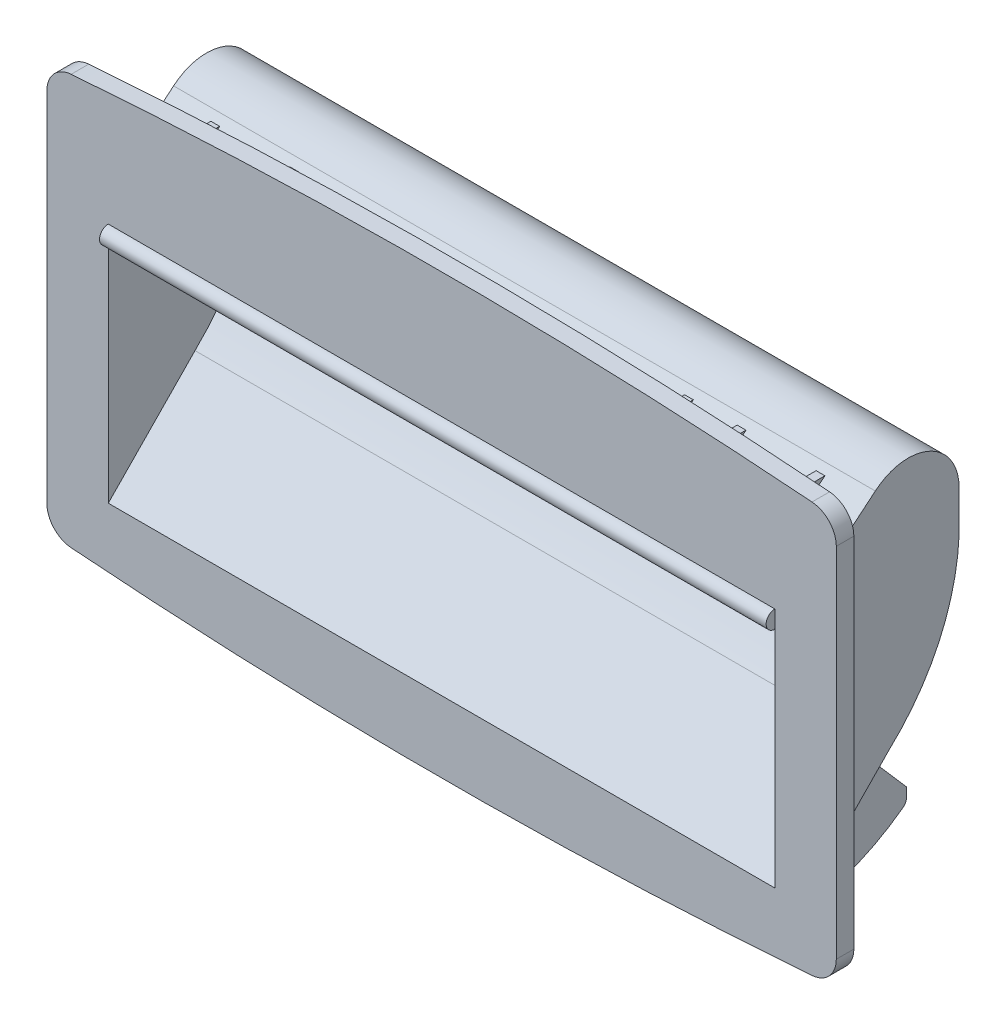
ISO-10303-21;
HEADER;
FILE_DESCRIPTION(('STEP AP214'),'2;1');
FILE_NAME('part.step','',(''),(''),'','','');
FILE_SCHEMA(('AUTOMOTIVE_DESIGN { 1 0 10303 214 1 1 1 1 }'));
ENDSEC;
DATA;
#1=APPLICATION_CONTEXT('core data for automotive mechanical design processes');
#2=APPLICATION_PROTOCOL_DEFINITION('international standard','automotive_design',2000,#1);
#3=PRODUCT_CONTEXT('',#1,'mechanical');
#4=PRODUCT('Part','Part','',(#3));
#5=PRODUCT_RELATED_PRODUCT_CATEGORY('part','',(#4));
#6=PRODUCT_DEFINITION_FORMATION('','',#4);
#7=PRODUCT_DEFINITION_CONTEXT('part definition',#1,'design');
#8=PRODUCT_DEFINITION('design','',#6,#7);
#9=PRODUCT_DEFINITION_SHAPE('','',#8);
#10=(LENGTH_UNIT() NAMED_UNIT(*) SI_UNIT(.MILLI.,.METRE.));
#11=(NAMED_UNIT(*) PLANE_ANGLE_UNIT() SI_UNIT($,.RADIAN.));
#12=(NAMED_UNIT(*) SI_UNIT($,.STERADIAN.) SOLID_ANGLE_UNIT());
#13=UNCERTAINTY_MEASURE_WITH_UNIT(LENGTH_MEASURE(1.E-05),#10,'distance_accuracy_value','');
#14=(GEOMETRIC_REPRESENTATION_CONTEXT(3) GLOBAL_UNCERTAINTY_ASSIGNED_CONTEXT((#13)) GLOBAL_UNIT_ASSIGNED_CONTEXT((#10,
#11,#12)) REPRESENTATION_CONTEXT('',''));
#15=CARTESIAN_POINT('',(0.,0.,0.));
#16=DIRECTION('',(0.,0.,1.));
#17=DIRECTION('',(1.,0.,0.));
#18=AXIS2_PLACEMENT_3D('',#15,#16,#17);
#19=CARTESIAN_POINT('',(-42.0000000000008,-20.3851849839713,2.));
#20=DIRECTION('',(0.,0.,1.));
#21=DIRECTION('',(1.,0.,0.));
#22=AXIS2_PLACEMENT_3D('',#19,#20,#21);
#23=PLANE('',#22);
#24=DIRECTION('',(0.,-1.,0.));
#25=VECTOR('',#24,1.);
#26=CARTESIAN_POINT('',(-45.,20.385184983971,2.));
#27=LINE('',#26,#25);
#28=CARTESIAN_POINT('',(-45.,20.385184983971,2.));
#29=VERTEX_POINT('',#28);
#30=CARTESIAN_POINT('',(-45.,-20.385184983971,2.));
#31=VERTEX_POINT('',#30);
#32=EDGE_CURVE('E650',#29,#31,#27,.T.);
#33=ORIENTED_EDGE('',*,*,#32,.T.);
#34=CARTESIAN_POINT('',(-42.0000000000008,-20.3851849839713,2.));
#35=DIRECTION('',(0.,0.,1.));
#36=DIRECTION('',(1.,0.,0.));
#37=AXIS2_PLACEMENT_3D('',#34,#35,#36);
#38=CIRCLE('',#37,2.99999999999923);
#39=CARTESIAN_POINT('',(-42.230347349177,-23.376328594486,2.));
#40=VERTEX_POINT('',#39);
#41=EDGE_CURVE('E652',#31,#40,#38,.T.);
#42=ORIENTED_EDGE('',*,*,#41,.T.);
#43=CARTESIAN_POINT('',(0.,524.999999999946,2.));
#44=DIRECTION('',(0.,0.,1.));
#45=DIRECTION('',(1.,0.,0.));
#46=AXIS2_PLACEMENT_3D('',#43,#44,#45);
#47=CIRCLE('',#46,549.999999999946);
#48=CARTESIAN_POINT('',(42.230347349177,-23.376328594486,2.));
#49=VERTEX_POINT('',#48);
#50=EDGE_CURVE('E656',#40,#49,#47,.T.);
#51=ORIENTED_EDGE('',*,*,#50,.T.);
#52=CARTESIAN_POINT('',(42.0000000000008,-20.3851849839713,2.));
#53=DIRECTION('',(0.,0.,1.));
#54=DIRECTION('',(-1.,0.,0.));
#55=AXIS2_PLACEMENT_3D('',#52,#53,#54);
#56=CIRCLE('',#55,2.99999999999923);
#57=CARTESIAN_POINT('',(45.,-20.385184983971,2.));
#58=VERTEX_POINT('',#57);
#59=EDGE_CURVE('E660',#49,#58,#56,.T.);
#60=ORIENTED_EDGE('',*,*,#59,.T.);
#61=DIRECTION('',(0.,1.,0.));
#62=VECTOR('',#61,1.);
#63=CARTESIAN_POINT('',(45.,-20.385184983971,2.));
#64=LINE('',#63,#62);
#65=CARTESIAN_POINT('',(45.,20.385184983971,2.));
#66=VERTEX_POINT('',#65);
#67=EDGE_CURVE('E664',#58,#66,#64,.T.);
#68=ORIENTED_EDGE('',*,*,#67,.T.);
#69=CARTESIAN_POINT('',(42.0000000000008,20.3851849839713,2.));
#70=DIRECTION('',(0.,0.,1.));
#71=DIRECTION('',(1.,0.,0.));
#72=AXIS2_PLACEMENT_3D('',#69,#70,#71);
#73=CIRCLE('',#72,2.99999999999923);
#74=CARTESIAN_POINT('',(42.230347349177,23.376328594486,2.));
#75=VERTEX_POINT('',#74);
#76=EDGE_CURVE('E668',#66,#75,#73,.T.);
#77=ORIENTED_EDGE('',*,*,#76,.T.);
#78=CARTESIAN_POINT('',(0.,-524.999999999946,2.));
#79=DIRECTION('',(0.,0.,1.));
#80=DIRECTION('',(1.,0.,0.));
#81=AXIS2_PLACEMENT_3D('',#78,#79,#80);
#82=CIRCLE('',#81,549.999999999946);
#83=CARTESIAN_POINT('',(-42.2303473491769,23.376328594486,2.));
#84=VERTEX_POINT('',#83);
#85=EDGE_CURVE('E672',#75,#84,#82,.T.);
#86=ORIENTED_EDGE('',*,*,#85,.T.);
#87=CARTESIAN_POINT('',(-42.0000000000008,20.3851849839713,2.));
#88=DIRECTION('',(0.,0.,1.));
#89=DIRECTION('',(1.,0.,0.));
#90=AXIS2_PLACEMENT_3D('',#87,#88,#89);
#91=CIRCLE('',#90,2.99999999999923);
#92=EDGE_CURVE('E676',#84,#29,#91,.T.);
#93=ORIENTED_EDGE('',*,*,#92,.T.);
#94=EDGE_LOOP('',(#33,#42,#51,#60,#68,#77,#86,#93));
#95=FACE_BOUND('',#94,.T.);
#96=DIRECTION('',(0.,1.,0.));
#97=VECTOR('',#96,1.);
#98=CARTESIAN_POINT('',(38.,-20.3851849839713,2.));
#99=LINE('',#98,#97);
#100=CARTESIAN_POINT('',(38.,-16.859413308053,2.));
#101=VERTEX_POINT('',#100);
#102=CARTESIAN_POINT('',(38.,8.78922396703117,2.));
#103=VERTEX_POINT('',#102);
#104=EDGE_CURVE('E789',#101,#103,#99,.T.);
#105=ORIENTED_EDGE('',*,*,#104,.F.);
#106=DIRECTION('',(1.,0.,0.));
#107=VECTOR('',#106,1.);
#108=CARTESIAN_POINT('',(-42.0000000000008,-16.859413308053,2.));
#109=LINE('',#108,#107);
#110=CARTESIAN_POINT('',(-38.,-16.859413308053,2.));
#111=VERTEX_POINT('',#110);
#112=EDGE_CURVE('E9',#111,#101,#109,.T.);
#113=ORIENTED_EDGE('',*,*,#112,.F.);
#114=DIRECTION('',(0.,1.,0.));
#115=VECTOR('',#114,1.);
#116=CARTESIAN_POINT('',(-38.,-20.3851849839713,2.));
#117=LINE('',#116,#115);
#118=CARTESIAN_POINT('',(-38.,8.78922396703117,2.));
#119=VERTEX_POINT('',#118);
#120=EDGE_CURVE('E786',#111,#119,#117,.T.);
#121=ORIENTED_EDGE('',*,*,#120,.T.);
#122=CARTESIAN_POINT('',(-38.,10.7,2.));
#123=VERTEX_POINT('',#122);
#124=EDGE_CURVE('E785',#119,#123,#117,.T.);
#125=ORIENTED_EDGE('',*,*,#124,.T.);
#126=DIRECTION('',(1.,0.,0.));
#127=VECTOR('',#126,1.);
#128=CARTESIAN_POINT('',(-38.,10.7,2.));
#129=LINE('',#128,#127);
#130=CARTESIAN_POINT('',(38.,10.7,2.));
#131=VERTEX_POINT('',#130);
#132=EDGE_CURVE('E782',#131,#123,#129,.F.);
#133=ORIENTED_EDGE('',*,*,#132,.F.);
#134=EDGE_CURVE('E37',#103,#131,#99,.T.);
#135=ORIENTED_EDGE('',*,*,#134,.F.);
#136=EDGE_LOOP('',(#105,#113,#121,#125,#133,#135));
#137=FACE_BOUND('',#136,.T.);
#138=ADVANCED_FACE('F14',(#95,#137),#23,.T.);
#139=CARTESIAN_POINT('',(-38.,9.7,2.));
#140=DIRECTION('',(1.,0.,0.));
#141=DIRECTION('',(0.,0.,-1.));
#142=AXIS2_PLACEMENT_3D('',#139,#140,#141);
#143=CYLINDRICAL_SURFACE('',#142,1.);
#144=DIRECTION('',(1.,0.,0.));
#145=VECTOR('',#144,1.);
#146=CARTESIAN_POINT('',(-38.,8.70509895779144,2.10085591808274));
#147=LINE('',#146,#145);
#148=CARTESIAN_POINT('',(38.,8.70509895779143,2.10085591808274));
#149=VERTEX_POINT('',#148);
#150=CARTESIAN_POINT('',(-38.,8.70509895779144,2.10085591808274));
#151=VERTEX_POINT('',#150);
#152=EDGE_CURVE('E29',#149,#151,#147,.F.);
#153=ORIENTED_EDGE('',*,*,#152,.F.);
#154=CARTESIAN_POINT('',(38.,9.7,2.));
#155=DIRECTION('',(1.,0.,0.));
#156=DIRECTION('',(0.,1.,0.));
#157=AXIS2_PLACEMENT_3D('',#154,#155,#156);
#158=CIRCLE('',#157,1.);
#159=EDGE_CURVE('E432',#131,#149,#158,.T.);
#160=ORIENTED_EDGE('',*,*,#159,.F.);
#161=ORIENTED_EDGE('',*,*,#132,.T.);
#162=CARTESIAN_POINT('',(-38.,9.7,2.));
#163=DIRECTION('',(1.,0.,0.));
#164=DIRECTION('',(0.,1.,0.));
#165=AXIS2_PLACEMENT_3D('',#162,#163,#164);
#166=CIRCLE('',#165,1.);
#167=EDGE_CURVE('E434',#123,#151,#166,.T.);
#168=ORIENTED_EDGE('',*,*,#167,.T.);
#169=EDGE_LOOP('',(#153,#160,#161,#168));
#170=FACE_BOUND('',#169,.T.);
#171=ADVANCED_FACE('F796',(#170),#143,.T.);
#172=CARTESIAN_POINT('',(38.,9.7,2.));
#173=DIRECTION('',(1.,0.,0.));
#174=DIRECTION('',(0.,1.,0.));
#175=AXIS2_PLACEMENT_3D('',#172,#173,#174);
#176=PLANE('',#175);
#177=ORIENTED_EDGE('',*,*,#159,.T.);
#178=DIRECTION('',(0.,-0.640536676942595,0.767927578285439));
#179=VECTOR('',#178,1.);
#180=CARTESIAN_POINT('',(38.,17.502088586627,-8.445692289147));
#181=LINE('',#180,#179);
#182=EDGE_CURVE('E414',#103,#149,#181,.T.);
#183=ORIENTED_EDGE('',*,*,#182,.F.);
#184=ORIENTED_EDGE('',*,*,#134,.T.);
#185=EDGE_LOOP('',(#177,#183,#184));
#186=FACE_BOUND('',#185,.T.);
#187=ADVANCED_FACE('F826',(#186),#176,.T.);
#188=CARTESIAN_POINT('',(-42.0000000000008,-20.3851849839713,0.));
#189=DIRECTION('',(0.,0.,1.));
#190=DIRECTION('',(1.,0.,0.));
#191=AXIS2_PLACEMENT_3D('',#188,#189,#190);
#192=PLANE('',#191);
#193=DIRECTION('',(0.,-1.,0.));
#194=VECTOR('',#193,1.);
#195=CARTESIAN_POINT('',(-45.,20.385184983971,0.));
#196=LINE('',#195,#194);
#197=CARTESIAN_POINT('',(-45.,20.385184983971,0.));
#198=VERTEX_POINT('',#197);
#199=CARTESIAN_POINT('',(-45.,-20.385184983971,0.));
#200=VERTEX_POINT('',#199);
#201=EDGE_CURVE('E680',#198,#200,#196,.T.);
#202=ORIENTED_EDGE('',*,*,#201,.F.);
#203=CARTESIAN_POINT('',(-42.0000000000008,20.3851849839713,0.));
#204=DIRECTION('',(0.,0.,1.));
#205=DIRECTION('',(1.,0.,0.));
#206=AXIS2_PLACEMENT_3D('',#203,#204,#205);
#207=CIRCLE('',#206,2.99999999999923);
#208=CARTESIAN_POINT('',(-42.2303473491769,23.376328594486,0.));
#209=VERTEX_POINT('',#208);
#210=EDGE_CURVE('E702',#209,#198,#207,.T.);
#211=ORIENTED_EDGE('',*,*,#210,.F.);
#212=CARTESIAN_POINT('',(0.,-524.999999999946,0.));
#213=DIRECTION('',(0.,0.,1.));
#214=DIRECTION('',(1.,0.,0.));
#215=AXIS2_PLACEMENT_3D('',#212,#213,#214);
#216=CIRCLE('',#215,549.999999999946);
#217=CARTESIAN_POINT('',(42.230347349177,23.376328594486,0.));
#218=VERTEX_POINT('',#217);
#219=EDGE_CURVE('E699',#218,#209,#216,.T.);
#220=ORIENTED_EDGE('',*,*,#219,.F.);
#221=CARTESIAN_POINT('',(42.0000000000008,20.3851849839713,0.));
#222=DIRECTION('',(0.,0.,1.));
#223=DIRECTION('',(1.,0.,0.));
#224=AXIS2_PLACEMENT_3D('',#221,#222,#223);
#225=CIRCLE('',#224,2.99999999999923);
#226=CARTESIAN_POINT('',(45.,20.385184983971,0.));
#227=VERTEX_POINT('',#226);
#228=EDGE_CURVE('E696',#227,#218,#225,.T.);
#229=ORIENTED_EDGE('',*,*,#228,.F.);
#230=DIRECTION('',(0.,1.,0.));
#231=VECTOR('',#230,1.);
#232=CARTESIAN_POINT('',(45.,-20.385184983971,0.));
#233=LINE('',#232,#231);
#234=CARTESIAN_POINT('',(45.,-20.385184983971,0.));
#235=VERTEX_POINT('',#234);
#236=EDGE_CURVE('E693',#235,#227,#233,.T.);
#237=ORIENTED_EDGE('',*,*,#236,.F.);
#238=CARTESIAN_POINT('',(42.0000000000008,-20.3851849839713,0.));
#239=DIRECTION('',(0.,0.,1.));
#240=DIRECTION('',(-1.,0.,0.));
#241=AXIS2_PLACEMENT_3D('',#238,#239,#240);
#242=CIRCLE('',#241,2.99999999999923);
#243=CARTESIAN_POINT('',(42.230347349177,-23.376328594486,0.));
#244=VERTEX_POINT('',#243);
#245=EDGE_CURVE('E690',#244,#235,#242,.T.);
#246=ORIENTED_EDGE('',*,*,#245,.F.);
#247=CARTESIAN_POINT('',(0.,524.999999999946,0.));
#248=DIRECTION('',(0.,0.,1.));
#249=DIRECTION('',(1.,0.,0.));
#250=AXIS2_PLACEMENT_3D('',#247,#248,#249);
#251=CIRCLE('',#250,549.999999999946);
#252=CARTESIAN_POINT('',(-42.230347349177,-23.376328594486,0.));
#253=VERTEX_POINT('',#252);
#254=EDGE_CURVE('E687',#253,#244,#251,.T.);
#255=ORIENTED_EDGE('',*,*,#254,.F.);
#256=CARTESIAN_POINT('',(-42.0000000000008,-20.3851849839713,0.));
#257=DIRECTION('',(0.,0.,1.));
#258=DIRECTION('',(1.,0.,0.));
#259=AXIS2_PLACEMENT_3D('',#256,#257,#258);
#260=CIRCLE('',#259,2.99999999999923);
#261=EDGE_CURVE('E684',#200,#253,#260,.T.);
#262=ORIENTED_EDGE('',*,*,#261,.F.);
#263=EDGE_LOOP('',(#202,#211,#220,#229,#237,#246,#255,#262));
#264=FACE_BOUND('',#263,.T.);
#265=DIRECTION('',(0.,-1.,0.));
#266=VECTOR('',#265,1.);
#267=CARTESIAN_POINT('',(35.,-20.3851849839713,0.));
#268=LINE('',#267,#266);
#269=CARTESIAN_POINT('',(35.,18.,0.));
#270=VERTEX_POINT('',#269);
#271=CARTESIAN_POINT('',(35.,12.410466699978,1.07700003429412E-09));
#272=VERTEX_POINT('',#271);
#273=EDGE_CURVE('E555',#270,#272,#268,.T.);
#274=ORIENTED_EDGE('',*,*,#273,.F.);
#275=DIRECTION('',(-1.,0.,0.));
#276=VECTOR('',#275,1.);
#277=CARTESIAN_POINT('',(-42.0000000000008,18.,0.));
#278=LINE('',#277,#276);
#279=CARTESIAN_POINT('',(34.,18.,0.));
#280=VERTEX_POINT('',#279);
#281=EDGE_CURVE('E500',#270,#280,#278,.T.);
#282=ORIENTED_EDGE('',*,*,#281,.T.);
#283=DIRECTION('',(0.,1.,0.));
#284=VECTOR('',#283,1.);
#285=CARTESIAN_POINT('',(34.,-20.3851849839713,0.));
#286=LINE('',#285,#284);
#287=CARTESIAN_POINT('',(34.,12.410466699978,1.07700003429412E-09));
#288=VERTEX_POINT('',#287);
#289=EDGE_CURVE('E552',#288,#280,#286,.T.);
#290=ORIENTED_EDGE('',*,*,#289,.F.);
#291=DIRECTION('',(1.,0.,0.));
#292=VECTOR('',#291,1.);
#293=CARTESIAN_POINT('',(-40.,12.410466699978,1.07700003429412E-09));
#294=LINE('',#293,#292);
#295=CARTESIAN_POINT('',(26.,12.410466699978,1.07700003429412E-09));
#296=VERTEX_POINT('',#295);
#297=EDGE_CURVE('E962',#296,#288,#294,.T.);
#298=ORIENTED_EDGE('',*,*,#297,.F.);
#299=DIRECTION('',(0.,-1.,0.));
#300=VECTOR('',#299,1.);
#301=CARTESIAN_POINT('',(26.,-20.3851849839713,0.));
#302=LINE('',#301,#300);
#303=CARTESIAN_POINT('',(26.,18.,0.));
#304=VERTEX_POINT('',#303);
#305=EDGE_CURVE('E549',#304,#296,#302,.T.);
#306=ORIENTED_EDGE('',*,*,#305,.F.);
#307=CARTESIAN_POINT('',(25.,18.,0.));
#308=VERTEX_POINT('',#307);
#309=EDGE_CURVE('E896',#304,#308,#278,.T.);
#310=ORIENTED_EDGE('',*,*,#309,.T.);
#311=DIRECTION('',(0.,1.,0.));
#312=VECTOR('',#311,1.);
#313=CARTESIAN_POINT('',(25.,-20.3851849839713,0.));
#314=LINE('',#313,#312);
#315=CARTESIAN_POINT('',(25.,12.410466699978,1.07700003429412E-09));
#316=VERTEX_POINT('',#315);
#317=EDGE_CURVE('E546',#316,#308,#314,.T.);
#318=ORIENTED_EDGE('',*,*,#317,.F.);
#319=CARTESIAN_POINT('',(20.,12.410466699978,1.07700003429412E-09));
#320=VERTEX_POINT('',#319);
#321=EDGE_CURVE('E958',#320,#316,#294,.T.);
#322=ORIENTED_EDGE('',*,*,#321,.F.);
#323=DIRECTION('',(0.,-1.,0.));
#324=VECTOR('',#323,1.);
#325=CARTESIAN_POINT('',(20.,-20.3851849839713,0.));
#326=LINE('',#325,#324);
#327=CARTESIAN_POINT('',(20.,18.,0.));
#328=VERTEX_POINT('',#327);
#329=EDGE_CURVE('E543',#328,#320,#326,.T.);
#330=ORIENTED_EDGE('',*,*,#329,.F.);
#331=CARTESIAN_POINT('',(19.,18.,0.));
#332=VERTEX_POINT('',#331);
#333=EDGE_CURVE('E1143',#328,#332,#278,.T.);
#334=ORIENTED_EDGE('',*,*,#333,.T.);
#335=DIRECTION('',(0.,1.,0.));
#336=VECTOR('',#335,1.);
#337=CARTESIAN_POINT('',(19.,-20.3851849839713,0.));
#338=LINE('',#337,#336);
#339=CARTESIAN_POINT('',(19.,12.410466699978,1.07700003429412E-09));
#340=VERTEX_POINT('',#339);
#341=EDGE_CURVE('E540',#340,#332,#338,.T.);
#342=ORIENTED_EDGE('',*,*,#341,.F.);
#343=CARTESIAN_POINT('',(11.,12.410466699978,1.07700003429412E-09));
#344=VERTEX_POINT('',#343);
#345=EDGE_CURVE('E954',#344,#340,#294,.T.);
#346=ORIENTED_EDGE('',*,*,#345,.F.);
#347=DIRECTION('',(0.,-1.,0.));
#348=VECTOR('',#347,1.);
#349=CARTESIAN_POINT('',(11.,-20.3851849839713,0.));
#350=LINE('',#349,#348);
#351=CARTESIAN_POINT('',(11.,18.,0.));
#352=VERTEX_POINT('',#351);
#353=EDGE_CURVE('E537',#352,#344,#350,.T.);
#354=ORIENTED_EDGE('',*,*,#353,.F.);
#355=CARTESIAN_POINT('',(10.,18.,0.));
#356=VERTEX_POINT('',#355);
#357=EDGE_CURVE('E1144',#352,#356,#278,.T.);
#358=ORIENTED_EDGE('',*,*,#357,.T.);
#359=DIRECTION('',(0.,1.,0.));
#360=VECTOR('',#359,1.);
#361=CARTESIAN_POINT('',(10.,-20.3851849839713,0.));
#362=LINE('',#361,#360);
#363=CARTESIAN_POINT('',(10.,12.410466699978,1.07700003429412E-09));
#364=VERTEX_POINT('',#363);
#365=EDGE_CURVE('E534',#364,#356,#362,.T.);
#366=ORIENTED_EDGE('',*,*,#365,.F.);
#367=CARTESIAN_POINT('',(5.,12.410466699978,1.07700003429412E-09));
#368=VERTEX_POINT('',#367);
#369=EDGE_CURVE('E950',#368,#364,#294,.T.);
#370=ORIENTED_EDGE('',*,*,#369,.F.);
#371=DIRECTION('',(0.,-1.,0.));
#372=VECTOR('',#371,1.);
#373=CARTESIAN_POINT('',(5.,-20.3851849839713,0.));
#374=LINE('',#373,#372);
#375=CARTESIAN_POINT('',(5.,18.,0.));
#376=VERTEX_POINT('',#375);
#377=EDGE_CURVE('E531',#376,#368,#374,.T.);
#378=ORIENTED_EDGE('',*,*,#377,.F.);
#379=CARTESIAN_POINT('',(4.,18.,0.));
#380=VERTEX_POINT('',#379);
#381=EDGE_CURVE('E1146',#376,#380,#278,.T.);
#382=ORIENTED_EDGE('',*,*,#381,.T.);
#383=DIRECTION('',(0.,1.,0.));
#384=VECTOR('',#383,1.);
#385=CARTESIAN_POINT('',(4.,-20.3851849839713,0.));
#386=LINE('',#385,#384);
#387=CARTESIAN_POINT('',(4.,12.410466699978,1.07700003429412E-09));
#388=VERTEX_POINT('',#387);
#389=EDGE_CURVE('E528',#388,#380,#386,.T.);
#390=ORIENTED_EDGE('',*,*,#389,.F.);
#391=CARTESIAN_POINT('',(-4.,12.410466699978,1.07700003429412E-09));
#392=VERTEX_POINT('',#391);
#393=EDGE_CURVE('E946',#392,#388,#294,.T.);
#394=ORIENTED_EDGE('',*,*,#393,.F.);
#395=DIRECTION('',(0.,-1.,0.));
#396=VECTOR('',#395,1.);
#397=CARTESIAN_POINT('',(-4.,-20.3851849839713,0.));
#398=LINE('',#397,#396);
#399=CARTESIAN_POINT('',(-4.,18.,0.));
#400=VERTEX_POINT('',#399);
#401=EDGE_CURVE('E525',#400,#392,#398,.T.);
#402=ORIENTED_EDGE('',*,*,#401,.F.);
#403=CARTESIAN_POINT('',(-5.,18.,0.));
#404=VERTEX_POINT('',#403);
#405=EDGE_CURVE('E1148',#400,#404,#278,.T.);
#406=ORIENTED_EDGE('',*,*,#405,.T.);
#407=DIRECTION('',(0.,1.,0.));
#408=VECTOR('',#407,1.);
#409=CARTESIAN_POINT('',(-5.,-20.3851849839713,0.));
#410=LINE('',#409,#408);
#411=CARTESIAN_POINT('',(-5.,12.410466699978,1.07700003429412E-09));
#412=VERTEX_POINT('',#411);
#413=EDGE_CURVE('E522',#412,#404,#410,.T.);
#414=ORIENTED_EDGE('',*,*,#413,.F.);
#415=CARTESIAN_POINT('',(-10.,12.410466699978,1.07700003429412E-09));
#416=VERTEX_POINT('',#415);
#417=EDGE_CURVE('E942',#416,#412,#294,.T.);
#418=ORIENTED_EDGE('',*,*,#417,.F.);
#419=DIRECTION('',(0.,-1.,0.));
#420=VECTOR('',#419,1.);
#421=CARTESIAN_POINT('',(-10.,-20.3851849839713,0.));
#422=LINE('',#421,#420);
#423=CARTESIAN_POINT('',(-10.,18.,0.));
#424=VERTEX_POINT('',#423);
#425=EDGE_CURVE('E519',#424,#416,#422,.T.);
#426=ORIENTED_EDGE('',*,*,#425,.F.);
#427=CARTESIAN_POINT('',(-11.,18.,0.));
#428=VERTEX_POINT('',#427);
#429=EDGE_CURVE('E1150',#424,#428,#278,.T.);
#430=ORIENTED_EDGE('',*,*,#429,.T.);
#431=DIRECTION('',(0.,1.,0.));
#432=VECTOR('',#431,1.);
#433=CARTESIAN_POINT('',(-11.,-20.3851849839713,0.));
#434=LINE('',#433,#432);
#435=CARTESIAN_POINT('',(-11.,12.410466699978,1.07700003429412E-09));
#436=VERTEX_POINT('',#435);
#437=EDGE_CURVE('E516',#436,#428,#434,.T.);
#438=ORIENTED_EDGE('',*,*,#437,.F.);
#439=CARTESIAN_POINT('',(-19.,12.410466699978,1.07700003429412E-09));
#440=VERTEX_POINT('',#439);
#441=EDGE_CURVE('E938',#440,#436,#294,.T.);
#442=ORIENTED_EDGE('',*,*,#441,.F.);
#443=DIRECTION('',(0.,-1.,0.));
#444=VECTOR('',#443,1.);
#445=CARTESIAN_POINT('',(-19.,-20.3851849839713,0.));
#446=LINE('',#445,#444);
#447=CARTESIAN_POINT('',(-19.,18.,0.));
#448=VERTEX_POINT('',#447);
#449=EDGE_CURVE('E513',#448,#440,#446,.T.);
#450=ORIENTED_EDGE('',*,*,#449,.F.);
#451=CARTESIAN_POINT('',(-20.,18.,0.));
#452=VERTEX_POINT('',#451);
#453=EDGE_CURVE('E1152',#448,#452,#278,.T.);
#454=ORIENTED_EDGE('',*,*,#453,.T.);
#455=DIRECTION('',(0.,1.,0.));
#456=VECTOR('',#455,1.);
#457=CARTESIAN_POINT('',(-20.,-20.3851849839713,0.));
#458=LINE('',#457,#456);
#459=CARTESIAN_POINT('',(-20.,12.410466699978,1.07700003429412E-09));
#460=VERTEX_POINT('',#459);
#461=EDGE_CURVE('E510',#460,#452,#458,.T.);
#462=ORIENTED_EDGE('',*,*,#461,.F.);
#463=CARTESIAN_POINT('',(-25.,12.410466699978,1.07700003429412E-09));
#464=VERTEX_POINT('',#463);
#465=EDGE_CURVE('E936',#464,#460,#294,.T.);
#466=ORIENTED_EDGE('',*,*,#465,.F.);
#467=DIRECTION('',(0.,-1.,0.));
#468=VECTOR('',#467,1.);
#469=CARTESIAN_POINT('',(-25.,-20.3851849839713,0.));
#470=LINE('',#469,#468);
#471=CARTESIAN_POINT('',(-25.,18.,0.));
#472=VERTEX_POINT('',#471);
#473=EDGE_CURVE('E507',#472,#464,#470,.T.);
#474=ORIENTED_EDGE('',*,*,#473,.F.);
#475=CARTESIAN_POINT('',(-26.,18.,0.));
#476=VERTEX_POINT('',#475);
#477=EDGE_CURVE('E499',#472,#476,#278,.T.);
#478=ORIENTED_EDGE('',*,*,#477,.T.);
#479=DIRECTION('',(0.,1.,0.));
#480=VECTOR('',#479,1.);
#481=CARTESIAN_POINT('',(-26.,-20.3851849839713,0.));
#482=LINE('',#481,#480);
#483=CARTESIAN_POINT('',(-26.,12.410466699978,1.07700003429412E-09));
#484=VERTEX_POINT('',#483);
#485=EDGE_CURVE('E504',#484,#476,#482,.T.);
#486=ORIENTED_EDGE('',*,*,#485,.F.);
#487=CARTESIAN_POINT('',(-34.,12.410466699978,1.07700003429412E-09));
#488=VERTEX_POINT('',#487);
#489=EDGE_CURVE('E651',#488,#484,#294,.T.);
#490=ORIENTED_EDGE('',*,*,#489,.F.);
#491=DIRECTION('',(0.,-1.,0.));
#492=VECTOR('',#491,1.);
#493=CARTESIAN_POINT('',(-34.,-20.3851849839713,0.));
#494=LINE('',#493,#492);
#495=CARTESIAN_POINT('',(-34.,18.,0.));
#496=VERTEX_POINT('',#495);
#497=EDGE_CURVE('E501',#496,#488,#494,.T.);
#498=ORIENTED_EDGE('',*,*,#497,.F.);
#499=CARTESIAN_POINT('',(-35.,18.,0.));
#500=VERTEX_POINT('',#499);
#501=EDGE_CURVE('E495',#496,#500,#278,.T.);
#502=ORIENTED_EDGE('',*,*,#501,.T.);
#503=DIRECTION('',(0.,1.,0.));
#504=VECTOR('',#503,1.);
#505=CARTESIAN_POINT('',(-35.,-20.3851849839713,0.));
#506=LINE('',#505,#504);
#507=CARTESIAN_POINT('',(-35.,12.410466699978,1.07700003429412E-09));
#508=VERTEX_POINT('',#507);
#509=EDGE_CURVE('E558',#508,#500,#506,.T.);
#510=ORIENTED_EDGE('',*,*,#509,.F.);
#511=CARTESIAN_POINT('',(-40.,12.410466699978,1.07700003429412E-09));
#512=VERTEX_POINT('',#511);
#513=EDGE_CURVE('E647',#512,#508,#294,.T.);
#514=ORIENTED_EDGE('',*,*,#513,.F.);
#515=DIRECTION('',(0.,-1.,-3.20853194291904E-11));
#516=VECTOR('',#515,1.);
#517=CARTESIAN_POINT('',(-40.,12.410466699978,1.07700003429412E-09));
#518=LINE('',#517,#516);
#519=CARTESIAN_POINT('',(-40.,-16.95810665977,1.34699976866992E-10));
#520=VERTEX_POINT('',#519);
#521=EDGE_CURVE('E617',#512,#520,#518,.T.);
#522=ORIENTED_EDGE('',*,*,#521,.T.);
#523=DIRECTION('',(1.,0.,0.));
#524=VECTOR('',#523,1.);
#525=CARTESIAN_POINT('',(-40.,-16.95810665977,1.34699976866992E-10));
#526=LINE('',#525,#524);
#527=CARTESIAN_POINT('',(-38.,-16.95810665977,1.34699976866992E-10));
#528=VERTEX_POINT('',#527);
#529=EDGE_CURVE('E643',#520,#528,#526,.T.);
#530=ORIENTED_EDGE('',*,*,#529,.T.);
#531=DIRECTION('',(0.,-1.,-3.22232806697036E-11));
#532=VECTOR('',#531,1.);
#533=CARTESIAN_POINT('',(-38.,-16.927610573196,1.30500211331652E-10));
#534=LINE('',#533,#532);
#535=CARTESIAN_POINT('',(-38.,-20.97748410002,0.));
#536=VERTEX_POINT('',#535);
#537=EDGE_CURVE('E576',#528,#536,#534,.T.);
#538=ORIENTED_EDGE('',*,*,#537,.T.);
#539=DIRECTION('',(1.,0.,0.));
#540=VECTOR('',#539,1.);
#541=CARTESIAN_POINT('',(-38.,-20.97748410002,0.));
#542=LINE('',#541,#540);
#543=CARTESIAN_POINT('',(38.,-20.97748410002,0.));
#544=VERTEX_POINT('',#543);
#545=EDGE_CURVE('E596',#536,#544,#542,.T.);
#546=ORIENTED_EDGE('',*,*,#545,.T.);
#547=DIRECTION('',(0.,-1.,-3.22232806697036E-11));
#548=VECTOR('',#547,1.);
#549=CARTESIAN_POINT('',(38.,-16.927610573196,1.30500211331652E-10));
#550=LINE('',#549,#548);
#551=CARTESIAN_POINT('',(38.,-16.95810665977,1.34699976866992E-10));
#552=VERTEX_POINT('',#551);
#553=EDGE_CURVE('E561',#552,#544,#550,.T.);
#554=ORIENTED_EDGE('',*,*,#553,.F.);
#555=CARTESIAN_POINT('',(40.,-16.95810665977,0.));
#556=VERTEX_POINT('',#555);
#557=EDGE_CURVE('E642',#552,#556,#526,.T.);
#558=ORIENTED_EDGE('',*,*,#557,.T.);
#559=DIRECTION('',(0.,-1.,-3.20853194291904E-11));
#560=VECTOR('',#559,1.);
#561=CARTESIAN_POINT('',(40.,12.410466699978,1.07700003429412E-09));
#562=LINE('',#561,#560);
#563=CARTESIAN_POINT('',(40.,12.4104667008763,0.));
#564=VERTEX_POINT('',#563);
#565=EDGE_CURVE('E599',#564,#556,#562,.T.);
#566=ORIENTED_EDGE('',*,*,#565,.F.);
#567=EDGE_CURVE('E646',#272,#564,#294,.T.);
#568=ORIENTED_EDGE('',*,*,#567,.F.);
#569=EDGE_LOOP('',(#274,#282,#290,#298,#306,#310,#318,#322,#330,#334,#342,#346,#354,#358,#366,
#370,#378,#382,#390,#394,#402,#406,#414,#418,#426,#430,#438,#442,#450,#454,#462,#466,#474,#478,
#486,#490,#498,#502,#510,#514,#522,#530,#538,#546,#554,#558,#566,#568));
#570=FACE_BOUND('',#569,.T.);
#571=ADVANCED_FACE('F832',(#264,#570),#192,.F.);
#572=CARTESIAN_POINT('',(-40.,18.621364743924,-7.4461308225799));
#573=DIRECTION('',(0.,0.767927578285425,0.640536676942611));
#574=DIRECTION('',(0.,-0.640536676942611,0.767927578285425));
#575=AXIS2_PLACEMENT_3D('',#572,#573,#574);
#576=PLANE('',#575);
#577=DIRECTION('',(-1.,0.,0.));
#578=VECTOR('',#577,1.);
#579=CARTESIAN_POINT('',(-40.,18.,-6.70118812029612));
#580=LINE('',#579,#578);
#581=CARTESIAN_POINT('',(35.,18.,-6.70118812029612));
#582=VERTEX_POINT('',#581);
#583=CARTESIAN_POINT('',(34.,18.,-6.70118812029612));
#584=VERTEX_POINT('',#583);
#585=EDGE_CURVE('E734',#582,#584,#580,.T.);
#586=ORIENTED_EDGE('',*,*,#585,.F.);
#587=DIRECTION('',(0.,-0.640536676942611,0.767927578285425));
#588=VECTOR('',#587,1.);
#589=CARTESIAN_POINT('',(35.,18.621364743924,-7.4461308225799));
#590=LINE('',#589,#588);
#591=EDGE_CURVE('E780',#582,#272,#590,.T.);
#592=ORIENTED_EDGE('',*,*,#591,.T.);
#593=ORIENTED_EDGE('',*,*,#567,.T.);
#594=DIRECTION('',(0.,-0.640536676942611,0.767927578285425));
#595=VECTOR('',#594,1.);
#596=CARTESIAN_POINT('',(40.,18.621364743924,-7.4461308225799));
#597=LINE('',#596,#595);
#598=CARTESIAN_POINT('',(40.,18.621364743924,-7.4461308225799));
#599=VERTEX_POINT('',#598);
#600=EDGE_CURVE('E598',#599,#564,#597,.T.);
#601=ORIENTED_EDGE('',*,*,#600,.F.);
#602=DIRECTION('',(1.,0.,0.));
#603=VECTOR('',#602,1.);
#604=CARTESIAN_POINT('',(-40.,18.621364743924,-7.4461308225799));
#605=LINE('',#604,#603);
#606=CARTESIAN_POINT('',(-40.,18.621364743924,-7.4461308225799));
#607=VERTEX_POINT('',#606);
#608=EDGE_CURVE('E632',#607,#599,#605,.T.);
#609=ORIENTED_EDGE('',*,*,#608,.F.);
#610=DIRECTION('',(0.,-0.640536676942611,0.767927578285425));
#611=VECTOR('',#610,1.);
#612=CARTESIAN_POINT('',(-40.,18.621364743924,-7.4461308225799));
#613=LINE('',#612,#611);
#614=EDGE_CURVE('E614',#607,#512,#613,.T.);
#615=ORIENTED_EDGE('',*,*,#614,.T.);
#616=ORIENTED_EDGE('',*,*,#513,.T.);
#617=DIRECTION('',(0.,0.640536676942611,-0.767927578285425));
#618=VECTOR('',#617,1.);
#619=CARTESIAN_POINT('',(-35.,18.621364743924,-7.4461308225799));
#620=LINE('',#619,#618);
#621=CARTESIAN_POINT('',(-35.,18.,-6.70118812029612));
#622=VERTEX_POINT('',#621);
#623=EDGE_CURVE('E737',#508,#622,#620,.T.);
#624=ORIENTED_EDGE('',*,*,#623,.T.);
#625=CARTESIAN_POINT('',(-34.,18.,-6.70118812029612));
#626=VERTEX_POINT('',#625);
#627=EDGE_CURVE('E730',#626,#622,#580,.T.);
#628=ORIENTED_EDGE('',*,*,#627,.F.);
#629=DIRECTION('',(0.,-0.640536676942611,0.767927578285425));
#630=VECTOR('',#629,1.);
#631=CARTESIAN_POINT('',(-34.,18.621364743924,-7.4461308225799));
#632=LINE('',#631,#630);
#633=EDGE_CURVE('E733',#626,#488,#632,.T.);
#634=ORIENTED_EDGE('',*,*,#633,.T.);
#635=ORIENTED_EDGE('',*,*,#489,.T.);
#636=DIRECTION('',(0.,0.640536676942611,-0.767927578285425));
#637=VECTOR('',#636,1.);
#638=CARTESIAN_POINT('',(-26.,18.621364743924,-7.4461308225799));
#639=LINE('',#638,#637);
#640=CARTESIAN_POINT('',(-26.,18.,-6.70118812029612));
#641=VERTEX_POINT('',#640);
#642=EDGE_CURVE('E739',#484,#641,#639,.T.);
#643=ORIENTED_EDGE('',*,*,#642,.T.);
#644=CARTESIAN_POINT('',(-25.,18.,-6.70118812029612));
#645=VERTEX_POINT('',#644);
#646=EDGE_CURVE('E735',#645,#641,#580,.T.);
#647=ORIENTED_EDGE('',*,*,#646,.F.);
#648=DIRECTION('',(0.,-0.640536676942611,0.767927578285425));
#649=VECTOR('',#648,1.);
#650=CARTESIAN_POINT('',(-25.,18.621364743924,-7.4461308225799));
#651=LINE('',#650,#649);
#652=EDGE_CURVE('E741',#645,#464,#651,.T.);
#653=ORIENTED_EDGE('',*,*,#652,.T.);
#654=ORIENTED_EDGE('',*,*,#465,.T.);
#655=DIRECTION('',(0.,0.640536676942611,-0.767927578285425));
#656=VECTOR('',#655,1.);
#657=CARTESIAN_POINT('',(-20.,18.621364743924,-7.4461308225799));
#658=LINE('',#657,#656);
#659=CARTESIAN_POINT('',(-20.,18.,-6.70118812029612));
#660=VERTEX_POINT('',#659);
#661=EDGE_CURVE('E744',#460,#660,#658,.T.);
#662=ORIENTED_EDGE('',*,*,#661,.T.);
#663=CARTESIAN_POINT('',(-19.,18.,-6.70118812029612));
#664=VERTEX_POINT('',#663);
#665=EDGE_CURVE('E743',#664,#660,#580,.T.);
#666=ORIENTED_EDGE('',*,*,#665,.F.);
#667=DIRECTION('',(0.,-0.640536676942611,0.767927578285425));
#668=VECTOR('',#667,1.);
#669=CARTESIAN_POINT('',(-19.,18.621364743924,-7.4461308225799));
#670=LINE('',#669,#668);
#671=EDGE_CURVE('E746',#664,#440,#670,.T.);
#672=ORIENTED_EDGE('',*,*,#671,.T.);
#673=ORIENTED_EDGE('',*,*,#441,.T.);
#674=DIRECTION('',(0.,0.640536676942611,-0.767927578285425));
#675=VECTOR('',#674,1.);
#676=CARTESIAN_POINT('',(-11.,18.621364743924,-7.4461308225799));
#677=LINE('',#676,#675);
#678=CARTESIAN_POINT('',(-11.,18.,-6.70118812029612));
#679=VERTEX_POINT('',#678);
#680=EDGE_CURVE('E749',#436,#679,#677,.T.);
#681=ORIENTED_EDGE('',*,*,#680,.T.);
#682=CARTESIAN_POINT('',(-10.,18.,-6.70118812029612));
#683=VERTEX_POINT('',#682);
#684=EDGE_CURVE('E748',#683,#679,#580,.T.);
#685=ORIENTED_EDGE('',*,*,#684,.F.);
#686=DIRECTION('',(0.,-0.640536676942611,0.767927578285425));
#687=VECTOR('',#686,1.);
#688=CARTESIAN_POINT('',(-10.,18.621364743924,-7.4461308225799));
#689=LINE('',#688,#687);
#690=EDGE_CURVE('E751',#683,#416,#689,.T.);
#691=ORIENTED_EDGE('',*,*,#690,.T.);
#692=ORIENTED_EDGE('',*,*,#417,.T.);
#693=DIRECTION('',(0.,0.640536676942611,-0.767927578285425));
#694=VECTOR('',#693,1.);
#695=CARTESIAN_POINT('',(-5.,18.621364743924,-7.4461308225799));
#696=LINE('',#695,#694);
#697=CARTESIAN_POINT('',(-5.,18.,-6.70118812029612));
#698=VERTEX_POINT('',#697);
#699=EDGE_CURVE('E754',#412,#698,#696,.T.);
#700=ORIENTED_EDGE('',*,*,#699,.T.);
#701=CARTESIAN_POINT('',(-4.,18.,-6.70118812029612));
#702=VERTEX_POINT('',#701);
#703=EDGE_CURVE('E753',#702,#698,#580,.T.);
#704=ORIENTED_EDGE('',*,*,#703,.F.);
#705=DIRECTION('',(0.,-0.640536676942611,0.767927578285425));
#706=VECTOR('',#705,1.);
#707=CARTESIAN_POINT('',(-4.,18.621364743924,-7.4461308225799));
#708=LINE('',#707,#706);
#709=EDGE_CURVE('E756',#702,#392,#708,.T.);
#710=ORIENTED_EDGE('',*,*,#709,.T.);
#711=ORIENTED_EDGE('',*,*,#393,.T.);
#712=DIRECTION('',(0.,0.640536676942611,-0.767927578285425));
#713=VECTOR('',#712,1.);
#714=CARTESIAN_POINT('',(4.,18.621364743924,-7.4461308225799));
#715=LINE('',#714,#713);
#716=CARTESIAN_POINT('',(4.,18.,-6.70118812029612));
#717=VERTEX_POINT('',#716);
#718=EDGE_CURVE('E759',#388,#717,#715,.T.);
#719=ORIENTED_EDGE('',*,*,#718,.T.);
#720=CARTESIAN_POINT('',(5.,18.,-6.70118812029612));
#721=VERTEX_POINT('',#720);
#722=EDGE_CURVE('E758',#721,#717,#580,.T.);
#723=ORIENTED_EDGE('',*,*,#722,.F.);
#724=DIRECTION('',(0.,-0.640536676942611,0.767927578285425));
#725=VECTOR('',#724,1.);
#726=CARTESIAN_POINT('',(5.,18.621364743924,-7.4461308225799));
#727=LINE('',#726,#725);
#728=EDGE_CURVE('E761',#721,#368,#727,.T.);
#729=ORIENTED_EDGE('',*,*,#728,.T.);
#730=ORIENTED_EDGE('',*,*,#369,.T.);
#731=DIRECTION('',(0.,0.640536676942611,-0.767927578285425));
#732=VECTOR('',#731,1.);
#733=CARTESIAN_POINT('',(10.,18.621364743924,-7.4461308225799));
#734=LINE('',#733,#732);
#735=CARTESIAN_POINT('',(10.,18.,-6.70118812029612));
#736=VERTEX_POINT('',#735);
#737=EDGE_CURVE('E764',#364,#736,#734,.T.);
#738=ORIENTED_EDGE('',*,*,#737,.T.);
#739=CARTESIAN_POINT('',(11.,18.,-6.70118812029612));
#740=VERTEX_POINT('',#739);
#741=EDGE_CURVE('E763',#740,#736,#580,.T.);
#742=ORIENTED_EDGE('',*,*,#741,.F.);
#743=DIRECTION('',(0.,-0.640536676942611,0.767927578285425));
#744=VECTOR('',#743,1.);
#745=CARTESIAN_POINT('',(11.,18.621364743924,-7.4461308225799));
#746=LINE('',#745,#744);
#747=EDGE_CURVE('E766',#740,#344,#746,.T.);
#748=ORIENTED_EDGE('',*,*,#747,.T.);
#749=ORIENTED_EDGE('',*,*,#345,.T.);
#750=DIRECTION('',(0.,0.640536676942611,-0.767927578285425));
#751=VECTOR('',#750,1.);
#752=CARTESIAN_POINT('',(19.,18.621364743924,-7.4461308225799));
#753=LINE('',#752,#751);
#754=CARTESIAN_POINT('',(19.,18.,-6.70118812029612));
#755=VERTEX_POINT('',#754);
#756=EDGE_CURVE('E769',#340,#755,#753,.T.);
#757=ORIENTED_EDGE('',*,*,#756,.T.);
#758=CARTESIAN_POINT('',(20.,18.,-6.70118812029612));
#759=VERTEX_POINT('',#758);
#760=EDGE_CURVE('E768',#759,#755,#580,.T.);
#761=ORIENTED_EDGE('',*,*,#760,.F.);
#762=DIRECTION('',(0.,-0.640536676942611,0.767927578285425));
#763=VECTOR('',#762,1.);
#764=CARTESIAN_POINT('',(20.,18.621364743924,-7.4461308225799));
#765=LINE('',#764,#763);
#766=EDGE_CURVE('E771',#759,#320,#765,.T.);
#767=ORIENTED_EDGE('',*,*,#766,.T.);
#768=ORIENTED_EDGE('',*,*,#321,.T.);
#769=DIRECTION('',(0.,0.640536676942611,-0.767927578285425));
#770=VECTOR('',#769,1.);
#771=CARTESIAN_POINT('',(25.,18.621364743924,-7.4461308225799));
#772=LINE('',#771,#770);
#773=CARTESIAN_POINT('',(25.,18.,-6.70118812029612));
#774=VERTEX_POINT('',#773);
#775=EDGE_CURVE('E774',#316,#774,#772,.T.);
#776=ORIENTED_EDGE('',*,*,#775,.T.);
#777=CARTESIAN_POINT('',(26.,18.,-6.70118812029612));
#778=VERTEX_POINT('',#777);
#779=EDGE_CURVE('E773',#778,#774,#580,.T.);
#780=ORIENTED_EDGE('',*,*,#779,.F.);
#781=DIRECTION('',(0.,-0.640536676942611,0.767927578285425));
#782=VECTOR('',#781,1.);
#783=CARTESIAN_POINT('',(26.,18.621364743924,-7.4461308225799));
#784=LINE('',#783,#782);
#785=EDGE_CURVE('E776',#778,#296,#784,.T.);
#786=ORIENTED_EDGE('',*,*,#785,.T.);
#787=ORIENTED_EDGE('',*,*,#297,.T.);
#788=DIRECTION('',(0.,0.640536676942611,-0.767927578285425));
#789=VECTOR('',#788,1.);
#790=CARTESIAN_POINT('',(34.,18.621364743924,-7.4461308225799));
#791=LINE('',#790,#789);
#792=EDGE_CURVE('E778',#288,#584,#791,.T.);
#793=ORIENTED_EDGE('',*,*,#792,.T.);
#794=EDGE_LOOP('',(#586,#592,#593,#601,#609,#615,#616,#624,#628,#634,#635,#643,#647,#653,#654,
#662,#666,#672,#673,#681,#685,#691,#692,#700,#704,#710,#711,#719,#723,#729,#730,#738,#742,#748,
#749,#757,#761,#767,#768,#776,#780,#786,#787,#793));
#795=FACE_BOUND('',#794,.T.);
#796=ADVANCED_FACE('F830',(#795),#576,.T.);
#797=CARTESIAN_POINT('',(-40.,-16.95810665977,1.34699976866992E-10));
#798=DIRECTION('',(0.,-0.698584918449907,-0.715527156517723));
#799=DIRECTION('',(0.,0.715527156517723,-0.698584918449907));
#800=AXIS2_PLACEMENT_3D('',#797,#798,#799);
#801=PLANE('',#800);
#802=DIRECTION('',(0.,-0.715527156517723,0.698584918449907));
#803=VECTOR('',#802,1.);
#804=CARTESIAN_POINT('',(38.,-16.95810665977,1.34699976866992E-10));
#805=LINE('',#804,#803);
#806=CARTESIAN_POINT('',(38.,-8.69596454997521,-8.0665112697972));
#807=VERTEX_POINT('',#806);
#808=EDGE_CURVE('E727',#807,#552,#805,.T.);
#809=ORIENTED_EDGE('',*,*,#808,.F.);
#810=DIRECTION('',(1.,0.,0.));
#811=VECTOR('',#810,1.);
#812=CARTESIAN_POINT('',(-40.,-8.69596454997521,-8.0665112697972));
#813=LINE('',#812,#811);
#814=CARTESIAN_POINT('',(-38.,-8.69596454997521,-8.0665112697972));
#815=VERTEX_POINT('',#814);
#816=EDGE_CURVE('E723',#815,#807,#813,.T.);
#817=ORIENTED_EDGE('',*,*,#816,.F.);
#818=DIRECTION('',(0.,-0.715527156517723,0.698584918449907));
#819=VECTOR('',#818,1.);
#820=CARTESIAN_POINT('',(-38.,-16.95810665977,1.34699976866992E-10));
#821=LINE('',#820,#819);
#822=EDGE_CURVE('E725',#815,#528,#821,.T.);
#823=ORIENTED_EDGE('',*,*,#822,.T.);
#824=ORIENTED_EDGE('',*,*,#529,.F.);
#825=DIRECTION('',(0.,0.715527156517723,-0.698584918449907));
#826=VECTOR('',#825,1.);
#827=CARTESIAN_POINT('',(-40.,-16.95810665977,1.34699976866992E-10));
#828=LINE('',#827,#826);
#829=CARTESIAN_POINT('',(-40.,-7.7823891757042,-8.95845502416));
#830=VERTEX_POINT('',#829);
#831=EDGE_CURVE('E620',#520,#830,#828,.T.);
#832=ORIENTED_EDGE('',*,*,#831,.T.);
#833=DIRECTION('',(1.,0.,0.));
#834=VECTOR('',#833,1.);
#835=CARTESIAN_POINT('',(-40.,-7.7823891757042,-8.95845502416));
#836=LINE('',#835,#834);
#837=CARTESIAN_POINT('',(40.,-7.7823891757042,-8.95845502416));
#838=VERTEX_POINT('',#837);
#839=EDGE_CURVE('E640',#830,#838,#836,.T.);
#840=ORIENTED_EDGE('',*,*,#839,.T.);
#841=DIRECTION('',(0.,0.715527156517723,-0.698584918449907));
#842=VECTOR('',#841,1.);
#843=CARTESIAN_POINT('',(40.,-16.95810665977,1.34699976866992E-10));
#844=LINE('',#843,#842);
#845=EDGE_CURVE('E602',#556,#838,#844,.T.);
#846=ORIENTED_EDGE('',*,*,#845,.F.);
#847=ORIENTED_EDGE('',*,*,#557,.F.);
#848=EDGE_LOOP('',(#809,#817,#823,#824,#832,#840,#846,#847));
#849=FACE_BOUND('',#848,.T.);
#850=ADVANCED_FACE('F867',(#849),#801,.T.);
#851=CARTESIAN_POINT('',(-45.,20.385184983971,0.));
#852=DIRECTION('',(-1.,0.,0.));
#853=DIRECTION('',(0.,0.,1.));
#854=AXIS2_PLACEMENT_3D('',#851,#852,#853);
#855=PLANE('',#854);
#856=ORIENTED_EDGE('',*,*,#32,.F.);
#857=DIRECTION('',(0.,0.,1.));
#858=VECTOR('',#857,1.);
#859=CARTESIAN_POINT('',(-45.,20.385184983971,0.));
#860=LINE('',#859,#858);
#861=EDGE_CURVE('E705',#198,#29,#860,.T.);
#862=ORIENTED_EDGE('',*,*,#861,.F.);
#863=ORIENTED_EDGE('',*,*,#201,.T.);
#864=DIRECTION('',(0.,0.,1.));
#865=VECTOR('',#864,1.);
#866=CARTESIAN_POINT('',(-45.,-20.385184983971,0.));
#867=LINE('',#866,#865);
#868=EDGE_CURVE('E721',#200,#31,#867,.T.);
#869=ORIENTED_EDGE('',*,*,#868,.T.);
#870=EDGE_LOOP('',(#856,#862,#863,#869));
#871=FACE_BOUND('',#870,.T.);
#872=ADVANCED_FACE('F16',(#871),#855,.T.);
#873=CARTESIAN_POINT('',(-42.0000000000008,-20.3851849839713,0.));
#874=DIRECTION('',(0.,0.,1.));
#875=DIRECTION('',(1.,0.,0.));
#876=AXIS2_PLACEMENT_3D('',#873,#874,#875);
#877=CYLINDRICAL_SURFACE('',#876,2.99999999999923);
#878=ORIENTED_EDGE('',*,*,#41,.F.);
#879=ORIENTED_EDGE('',*,*,#868,.F.);
#880=ORIENTED_EDGE('',*,*,#261,.T.);
#881=DIRECTION('',(0.,0.,1.));
#882=VECTOR('',#881,1.);
#883=CARTESIAN_POINT('',(-42.230347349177,-23.376328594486,0.));
#884=LINE('',#883,#882);
#885=EDGE_CURVE('E719',#253,#40,#884,.T.);
#886=ORIENTED_EDGE('',*,*,#885,.T.);
#887=EDGE_LOOP('',(#878,#879,#880,#886));
#888=FACE_BOUND('',#887,.T.);
#889=ADVANCED_FACE('F859',(#888),#877,.T.);
#890=CARTESIAN_POINT('',(0.,524.999999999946,0.));
#891=DIRECTION('',(0.,0.,1.));
#892=DIRECTION('',(1.,0.,0.));
#893=AXIS2_PLACEMENT_3D('',#890,#891,#892);
#894=CYLINDRICAL_SURFACE('',#893,549.999999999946);
#895=ORIENTED_EDGE('',*,*,#50,.F.);
#896=ORIENTED_EDGE('',*,*,#885,.F.);
#897=ORIENTED_EDGE('',*,*,#254,.T.);
#898=DIRECTION('',(0.,0.,1.));
#899=VECTOR('',#898,1.);
#900=CARTESIAN_POINT('',(42.230347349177,-23.376328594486,0.));
#901=LINE('',#900,#899);
#902=EDGE_CURVE('E717',#244,#49,#901,.T.);
#903=ORIENTED_EDGE('',*,*,#902,.T.);
#904=EDGE_LOOP('',(#895,#896,#897,#903));
#905=FACE_BOUND('',#904,.T.);
#906=ADVANCED_FACE('F856',(#905),#894,.T.);
#907=CARTESIAN_POINT('',(42.0000000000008,-20.3851849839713,0.));
#908=DIRECTION('',(0.,0.,1.));
#909=DIRECTION('',(1.,0.,0.));
#910=AXIS2_PLACEMENT_3D('',#907,#908,#909);
#911=CYLINDRICAL_SURFACE('',#910,2.99999999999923);
#912=ORIENTED_EDGE('',*,*,#59,.F.);
#913=ORIENTED_EDGE('',*,*,#902,.F.);
#914=ORIENTED_EDGE('',*,*,#245,.T.);
#915=DIRECTION('',(0.,0.,1.));
#916=VECTOR('',#915,1.);
#917=CARTESIAN_POINT('',(45.,-20.385184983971,0.));
#918=LINE('',#917,#916);
#919=EDGE_CURVE('E715',#235,#58,#918,.T.);
#920=ORIENTED_EDGE('',*,*,#919,.T.);
#921=EDGE_LOOP('',(#912,#913,#914,#920));
#922=FACE_BOUND('',#921,.T.);
#923=ADVANCED_FACE('F852',(#922),#911,.T.);
#924=CARTESIAN_POINT('',(45.,-20.385184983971,0.));
#925=DIRECTION('',(1.,0.,0.));
#926=DIRECTION('',(0.,0.,-1.));
#927=AXIS2_PLACEMENT_3D('',#924,#925,#926);
#928=PLANE('',#927);
#929=ORIENTED_EDGE('',*,*,#67,.F.);
#930=ORIENTED_EDGE('',*,*,#919,.F.);
#931=ORIENTED_EDGE('',*,*,#236,.T.);
#932=DIRECTION('',(0.,0.,1.));
#933=VECTOR('',#932,1.);
#934=CARTESIAN_POINT('',(45.,20.385184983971,0.));
#935=LINE('',#934,#933);
#936=EDGE_CURVE('E713',#227,#66,#935,.T.);
#937=ORIENTED_EDGE('',*,*,#936,.T.);
#938=EDGE_LOOP('',(#929,#930,#931,#937));
#939=FACE_BOUND('',#938,.T.);
#940=ADVANCED_FACE('F848',(#939),#928,.T.);
#941=CARTESIAN_POINT('',(42.0000000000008,20.3851849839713,0.));
#942=DIRECTION('',(0.,0.,1.));
#943=DIRECTION('',(1.,0.,0.));
#944=AXIS2_PLACEMENT_3D('',#941,#942,#943);
#945=CYLINDRICAL_SURFACE('',#944,2.99999999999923);
#946=ORIENTED_EDGE('',*,*,#76,.F.);
#947=ORIENTED_EDGE('',*,*,#936,.F.);
#948=ORIENTED_EDGE('',*,*,#228,.T.);
#949=DIRECTION('',(0.,0.,1.));
#950=VECTOR('',#949,1.);
#951=CARTESIAN_POINT('',(42.230347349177,23.376328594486,0.));
#952=LINE('',#951,#950);
#953=EDGE_CURVE('E711',#218,#75,#952,.T.);
#954=ORIENTED_EDGE('',*,*,#953,.T.);
#955=EDGE_LOOP('',(#946,#947,#948,#954));
#956=FACE_BOUND('',#955,.T.);
#957=ADVANCED_FACE('F844',(#956),#945,.T.);
#958=CARTESIAN_POINT('',(0.,-524.999999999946,0.));
#959=DIRECTION('',(0.,0.,1.));
#960=DIRECTION('',(1.,0.,0.));
#961=AXIS2_PLACEMENT_3D('',#958,#959,#960);
#962=CYLINDRICAL_SURFACE('',#961,549.999999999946);
#963=ORIENTED_EDGE('',*,*,#85,.F.);
#964=ORIENTED_EDGE('',*,*,#953,.F.);
#965=ORIENTED_EDGE('',*,*,#219,.T.);
#966=DIRECTION('',(0.,0.,1.));
#967=VECTOR('',#966,1.);
#968=CARTESIAN_POINT('',(-42.2303473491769,23.376328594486,0.));
#969=LINE('',#968,#967);
#970=EDGE_CURVE('E709',#209,#84,#969,.T.);
#971=ORIENTED_EDGE('',*,*,#970,.T.);
#972=EDGE_LOOP('',(#963,#964,#965,#971));
#973=FACE_BOUND('',#972,.T.);
#974=ADVANCED_FACE('F840',(#973),#962,.T.);
#975=CARTESIAN_POINT('',(-42.0000000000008,20.3851849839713,0.));
#976=DIRECTION('',(0.,0.,1.));
#977=DIRECTION('',(1.,0.,0.));
#978=AXIS2_PLACEMENT_3D('',#975,#976,#977);
#979=CYLINDRICAL_SURFACE('',#978,2.99999999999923);
#980=ORIENTED_EDGE('',*,*,#92,.F.);
#981=ORIENTED_EDGE('',*,*,#970,.F.);
#982=ORIENTED_EDGE('',*,*,#210,.T.);
#983=ORIENTED_EDGE('',*,*,#861,.T.);
#984=EDGE_LOOP('',(#980,#981,#982,#983));
#985=FACE_BOUND('',#984,.T.);
#986=ADVANCED_FACE('F836',(#985),#979,.T.);
#987=CARTESIAN_POINT('',(-40.,10.609367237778,7.97504124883));
#988=DIRECTION('',(1.,0.,0.));
#989=DIRECTION('',(0.,0.,-1.));
#990=AXIS2_PLACEMENT_3D('',#987,#988,#989);
#991=CYLINDRICAL_SURFACE('',#990,25.0000000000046);
#992=DIRECTION('',(1.,0.,0.));
#993=VECTOR('',#992,1.);
#994=CARTESIAN_POINT('',(-40.,9.4925348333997,-17.));
#995=LINE('',#994,#993);
#996=CARTESIAN_POINT('',(-40.,9.4925348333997,-17.));
#997=VERTEX_POINT('',#996);
#998=CARTESIAN_POINT('',(40.,9.4925348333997,-17.));
#999=VERTEX_POINT('',#998);
#1000=EDGE_CURVE('E638',#997,#999,#995,.T.);
#1001=ORIENTED_EDGE('',*,*,#1000,.T.);
#1002=CARTESIAN_POINT('',(40.,10.609367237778,7.97504124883));
#1003=DIRECTION('',(1.,0.,0.));
#1004=DIRECTION('',(0.,1.,0.));
#1005=AXIS2_PLACEMENT_3D('',#1002,#1003,#1004);
#1006=CIRCLE('',#1005,25.0000000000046);
#1007=EDGE_CURVE('E605',#838,#999,#1006,.T.);
#1008=ORIENTED_EDGE('',*,*,#1007,.F.);
#1009=ORIENTED_EDGE('',*,*,#839,.F.);
#1010=CARTESIAN_POINT('',(-40.,10.609367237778,7.97504124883));
#1011=DIRECTION('',(1.,0.,0.));
#1012=DIRECTION('',(0.,1.,0.));
#1013=AXIS2_PLACEMENT_3D('',#1010,#1011,#1012);
#1014=CIRCLE('',#1013,25.0000000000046);
#1015=EDGE_CURVE('E623',#830,#997,#1014,.T.);
#1016=ORIENTED_EDGE('',*,*,#1015,.T.);
#1017=EDGE_LOOP('',(#1001,#1008,#1009,#1016));
#1018=FACE_BOUND('',#1017,.T.);
#1019=ADVANCED_FACE('F839',(#1018),#991,.T.);
#1020=CARTESIAN_POINT('',(-40.,9.4925348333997,-17.));
#1021=DIRECTION('',(0.,0.,-1.));
#1022=DIRECTION('',(-1.,0.,0.));
#1023=AXIS2_PLACEMENT_3D('',#1020,#1021,#1022);
#1024=PLANE('',#1023);
#1025=DIRECTION('',(1.,0.,0.));
#1026=VECTOR('',#1025,1.);
#1027=CARTESIAN_POINT('',(-40.,14.2,-17.));
#1028=LINE('',#1027,#1026);
#1029=CARTESIAN_POINT('',(-40.,14.2,-17.));
#1030=VERTEX_POINT('',#1029);
#1031=CARTESIAN_POINT('',(40.,14.2,-17.));
#1032=VERTEX_POINT('',#1031);
#1033=EDGE_CURVE('E636',#1030,#1032,#1028,.T.);
#1034=ORIENTED_EDGE('',*,*,#1033,.T.);
#1035=DIRECTION('',(0.,1.,0.));
#1036=VECTOR('',#1035,1.);
#1037=CARTESIAN_POINT('',(40.,9.4925348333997,-17.));
#1038=LINE('',#1037,#1036);
#1039=EDGE_CURVE('E608',#999,#1032,#1038,.T.);
#1040=ORIENTED_EDGE('',*,*,#1039,.F.);
#1041=ORIENTED_EDGE('',*,*,#1000,.F.);
#1042=DIRECTION('',(0.,1.,0.));
#1043=VECTOR('',#1042,1.);
#1044=CARTESIAN_POINT('',(-40.,9.4925348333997,-17.));
#1045=LINE('',#1044,#1043);
#1046=EDGE_CURVE('E626',#997,#1030,#1045,.T.);
#1047=ORIENTED_EDGE('',*,*,#1046,.T.);
#1048=EDGE_LOOP('',(#1034,#1040,#1041,#1047));
#1049=FACE_BOUND('',#1048,.T.);
#1050=ADVANCED_FACE('F1024',(#1049),#1024,.T.);
#1051=CARTESIAN_POINT('',(-40.,14.2,-11.2));
#1052=DIRECTION('',(1.,0.,0.));
#1053=DIRECTION('',(0.,0.,-1.));
#1054=AXIS2_PLACEMENT_3D('',#1051,#1052,#1053);
#1055=CYLINDRICAL_SURFACE('',#1054,5.8);
#1056=ORIENTED_EDGE('',*,*,#608,.T.);
#1057=CARTESIAN_POINT('',(40.,14.2,-11.2));
#1058=DIRECTION('',(1.,0.,0.));
#1059=DIRECTION('',(0.,-1.,0.));
#1060=AXIS2_PLACEMENT_3D('',#1057,#1058,#1059);
#1061=CIRCLE('',#1060,5.8);
#1062=EDGE_CURVE('E611',#1032,#599,#1061,.T.);
#1063=ORIENTED_EDGE('',*,*,#1062,.F.);
#1064=ORIENTED_EDGE('',*,*,#1033,.F.);
#1065=CARTESIAN_POINT('',(-40.,14.2,-11.2));
#1066=DIRECTION('',(1.,0.,0.));
#1067=DIRECTION('',(0.,-1.,0.));
#1068=AXIS2_PLACEMENT_3D('',#1065,#1066,#1067);
#1069=CIRCLE('',#1068,5.8);
#1070=EDGE_CURVE('E629',#1030,#607,#1069,.T.);
#1071=ORIENTED_EDGE('',*,*,#1070,.T.);
#1072=EDGE_LOOP('',(#1056,#1063,#1064,#1071));
#1073=FACE_BOUND('',#1072,.T.);
#1074=ADVANCED_FACE('F1020',(#1073),#1055,.T.);
#1075=CARTESIAN_POINT('',(-40.,10.609367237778,7.97504124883));
#1076=DIRECTION('',(1.,0.,0.));
#1077=DIRECTION('',(0.,1.,0.));
#1078=AXIS2_PLACEMENT_3D('',#1075,#1076,#1077);
#1079=PLANE('',#1078);
#1080=ORIENTED_EDGE('',*,*,#614,.F.);
#1081=ORIENTED_EDGE('',*,*,#1070,.F.);
#1082=ORIENTED_EDGE('',*,*,#1046,.F.);
#1083=ORIENTED_EDGE('',*,*,#1015,.F.);
#1084=ORIENTED_EDGE('',*,*,#831,.F.);
#1085=ORIENTED_EDGE('',*,*,#521,.F.);
#1086=EDGE_LOOP('',(#1080,#1081,#1082,#1083,#1084,#1085));
#1087=FACE_BOUND('',#1086,.T.);
#1088=ADVANCED_FACE('F1016',(#1087),#1079,.F.);
#1089=CARTESIAN_POINT('',(40.,10.609367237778,7.97504124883));
#1090=DIRECTION('',(1.,0.,0.));
#1091=DIRECTION('',(0.,1.,0.));
#1092=AXIS2_PLACEMENT_3D('',#1089,#1090,#1091);
#1093=PLANE('',#1092);
#1094=ORIENTED_EDGE('',*,*,#600,.T.);
#1095=ORIENTED_EDGE('',*,*,#565,.T.);
#1096=ORIENTED_EDGE('',*,*,#845,.T.);
#1097=ORIENTED_EDGE('',*,*,#1007,.T.);
#1098=ORIENTED_EDGE('',*,*,#1039,.T.);
#1099=ORIENTED_EDGE('',*,*,#1062,.T.);
#1100=EDGE_LOOP('',(#1094,#1095,#1096,#1097,#1098,#1099));
#1101=FACE_BOUND('',#1100,.T.);
#1102=ADVANCED_FACE('F1012',(#1101),#1093,.T.);
#1103=CARTESIAN_POINT('',(-38.,3.43854363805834,2.02671889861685));
#1104=DIRECTION('',(1.,0.,0.));
#1105=DIRECTION('',(0.,0.,-1.));
#1106=AXIS2_PLACEMENT_3D('',#1103,#1104,#1105);
#1107=CYLINDRICAL_SURFACE('',#1106,24.5000000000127);
#1108=DIRECTION('',(1.,0.,0.));
#1109=VECTOR('',#1108,1.);
#1110=CARTESIAN_POINT('',(-38.,-16.218523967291,-12.59688165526));
#1111=LINE('',#1110,#1109);
#1112=CARTESIAN_POINT('',(-38.,-16.218523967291,-12.59688165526));
#1113=VERTEX_POINT('',#1112);
#1114=CARTESIAN_POINT('',(38.,-16.218523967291,-12.59688165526));
#1115=VERTEX_POINT('',#1114);
#1116=EDGE_CURVE('E594',#1113,#1115,#1111,.T.);
#1117=ORIENTED_EDGE('',*,*,#1116,.T.);
#1118=CARTESIAN_POINT('',(38.,3.43854363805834,2.02671889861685));
#1119=DIRECTION('',(1.,0.,0.));
#1120=DIRECTION('',(0.,1.,0.));
#1121=AXIS2_PLACEMENT_3D('',#1118,#1119,#1120);
#1122=CIRCLE('',#1121,24.5000000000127);
#1123=EDGE_CURVE('E564',#544,#1115,#1122,.T.);
#1124=ORIENTED_EDGE('',*,*,#1123,.F.);
#1125=ORIENTED_EDGE('',*,*,#545,.F.);
#1126=CARTESIAN_POINT('',(-38.,3.43854363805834,2.02671889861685));
#1127=DIRECTION('',(1.,0.,0.));
#1128=DIRECTION('',(0.,1.,0.));
#1129=AXIS2_PLACEMENT_3D('',#1126,#1127,#1128);
#1130=CIRCLE('',#1129,24.5000000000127);
#1131=EDGE_CURVE('E578',#536,#1113,#1130,.T.);
#1132=ORIENTED_EDGE('',*,*,#1131,.T.);
#1133=EDGE_LOOP('',(#1117,#1124,#1125,#1132));
#1134=FACE_BOUND('',#1133,.T.);
#1135=ADVANCED_FACE('F1008',(#1134),#1107,.T.);
#1136=CARTESIAN_POINT('',(-38.,-15.416194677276,-11.9999999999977));
#1137=DIRECTION('',(1.,0.,0.));
#1138=DIRECTION('',(0.,0.,-1.));
#1139=AXIS2_PLACEMENT_3D('',#1136,#1137,#1138);
#1140=CYLINDRICAL_SURFACE('',#1139,1.00000000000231);
#1141=DIRECTION('',(1.,0.,0.));
#1142=VECTOR('',#1141,1.);
#1143=CARTESIAN_POINT('',(-38.,-15.416194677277,-13.));
#1144=LINE('',#1143,#1142);
#1145=CARTESIAN_POINT('',(-38.,-15.416194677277,-13.));
#1146=VERTEX_POINT('',#1145);
#1147=CARTESIAN_POINT('',(38.,-15.416194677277,-13.));
#1148=VERTEX_POINT('',#1147);
#1149=EDGE_CURVE('E592',#1146,#1148,#1144,.T.);
#1150=ORIENTED_EDGE('',*,*,#1149,.T.);
#1151=CARTESIAN_POINT('',(38.,-15.416194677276,-11.9999999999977));
#1152=DIRECTION('',(1.,0.,0.));
#1153=DIRECTION('',(0.,1.,0.));
#1154=AXIS2_PLACEMENT_3D('',#1151,#1152,#1153);
#1155=CIRCLE('',#1154,1.00000000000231);
#1156=EDGE_CURVE('E567',#1115,#1148,#1155,.T.);
#1157=ORIENTED_EDGE('',*,*,#1156,.F.);
#1158=ORIENTED_EDGE('',*,*,#1116,.F.);
#1159=CARTESIAN_POINT('',(-38.,-15.416194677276,-11.9999999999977));
#1160=DIRECTION('',(1.,0.,0.));
#1161=DIRECTION('',(0.,1.,0.));
#1162=AXIS2_PLACEMENT_3D('',#1159,#1160,#1161);
#1163=CIRCLE('',#1162,1.00000000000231);
#1164=EDGE_CURVE('E581',#1113,#1146,#1163,.T.);
#1165=ORIENTED_EDGE('',*,*,#1164,.T.);
#1166=EDGE_LOOP('',(#1150,#1157,#1158,#1165));
#1167=FACE_BOUND('',#1166,.T.);
#1168=ADVANCED_FACE('F1004',(#1167),#1140,.T.);
#1169=CARTESIAN_POINT('',(-38.,-15.416194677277,-13.));
#1170=DIRECTION('',(0.,0.,-1.));
#1171=DIRECTION('',(-1.,0.,0.));
#1172=AXIS2_PLACEMENT_3D('',#1169,#1170,#1171);
#1173=PLANE('',#1172);
#1174=DIRECTION('',(1.,0.,0.));
#1175=VECTOR('',#1174,1.);
#1176=CARTESIAN_POINT('',(-38.,-14.371291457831,-13.));
#1177=LINE('',#1176,#1175);
#1178=CARTESIAN_POINT('',(-38.,-14.371291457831,-13.));
#1179=VERTEX_POINT('',#1178);
#1180=CARTESIAN_POINT('',(38.,-14.371291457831,-13.));
#1181=VERTEX_POINT('',#1180);
#1182=EDGE_CURVE('E590',#1179,#1181,#1177,.T.);
#1183=ORIENTED_EDGE('',*,*,#1182,.T.);
#1184=DIRECTION('',(0.,1.,0.));
#1185=VECTOR('',#1184,1.);
#1186=CARTESIAN_POINT('',(38.,-15.416194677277,-13.));
#1187=LINE('',#1186,#1185);
#1188=EDGE_CURVE('E570',#1148,#1181,#1187,.T.);
#1189=ORIENTED_EDGE('',*,*,#1188,.F.);
#1190=ORIENTED_EDGE('',*,*,#1149,.F.);
#1191=DIRECTION('',(0.,1.,0.));
#1192=VECTOR('',#1191,1.);
#1193=CARTESIAN_POINT('',(-38.,-15.416194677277,-13.));
#1194=LINE('',#1193,#1192);
#1195=EDGE_CURVE('E584',#1146,#1179,#1194,.T.);
#1196=ORIENTED_EDGE('',*,*,#1195,.T.);
#1197=EDGE_LOOP('',(#1183,#1189,#1190,#1196));
#1198=FACE_BOUND('',#1197,.T.);
#1199=ADVANCED_FACE('F1000',(#1198),#1173,.T.);
#1200=CARTESIAN_POINT('',(-38.,-14.371291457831,-13.));
#1201=DIRECTION('',(0.,0.656059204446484,-0.754709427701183));
#1202=DIRECTION('',(0.,0.754709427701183,0.656059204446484));
#1203=AXIS2_PLACEMENT_3D('',#1200,#1201,#1202);
#1204=PLANE('',#1203);
#1205=DIRECTION('',(0.,0.754709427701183,0.656059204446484));
#1206=VECTOR('',#1205,1.);
#1207=CARTESIAN_POINT('',(-38.,-14.371291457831,-13.));
#1208=LINE('',#1207,#1206);
#1209=EDGE_CURVE('E587',#1179,#815,#1208,.T.);
#1210=ORIENTED_EDGE('',*,*,#1209,.T.);
#1211=ORIENTED_EDGE('',*,*,#816,.T.);
#1212=DIRECTION('',(0.,0.754709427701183,0.656059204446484));
#1213=VECTOR('',#1212,1.);
#1214=CARTESIAN_POINT('',(38.,-14.371291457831,-13.));
#1215=LINE('',#1214,#1213);
#1216=EDGE_CURVE('E573',#1181,#807,#1215,.T.);
#1217=ORIENTED_EDGE('',*,*,#1216,.F.);
#1218=ORIENTED_EDGE('',*,*,#1182,.F.);
#1219=EDGE_LOOP('',(#1210,#1211,#1217,#1218));
#1220=FACE_BOUND('',#1219,.T.);
#1221=ADVANCED_FACE('F996',(#1220),#1204,.T.);
#1222=CARTESIAN_POINT('',(-38.,3.43854363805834,2.02671889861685));
#1223=DIRECTION('',(1.,0.,0.));
#1224=DIRECTION('',(0.,1.,0.));
#1225=AXIS2_PLACEMENT_3D('',#1222,#1223,#1224);
#1226=PLANE('',#1225);
#1227=ORIENTED_EDGE('',*,*,#822,.F.);
#1228=ORIENTED_EDGE('',*,*,#1209,.F.);
#1229=ORIENTED_EDGE('',*,*,#1195,.F.);
#1230=ORIENTED_EDGE('',*,*,#1164,.F.);
#1231=ORIENTED_EDGE('',*,*,#1131,.F.);
#1232=ORIENTED_EDGE('',*,*,#537,.F.);
#1233=EDGE_LOOP('',(#1227,#1228,#1229,#1230,#1231,#1232));
#1234=FACE_BOUND('',#1233,.T.);
#1235=ADVANCED_FACE('F992',(#1234),#1226,.F.);
#1236=CARTESIAN_POINT('',(38.,3.43854363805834,2.02671889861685));
#1237=DIRECTION('',(1.,0.,0.));
#1238=DIRECTION('',(0.,1.,0.));
#1239=AXIS2_PLACEMENT_3D('',#1236,#1237,#1238);
#1240=PLANE('',#1239);
#1241=ORIENTED_EDGE('',*,*,#1216,.T.);
#1242=ORIENTED_EDGE('',*,*,#808,.T.);
#1243=ORIENTED_EDGE('',*,*,#553,.T.);
#1244=ORIENTED_EDGE('',*,*,#1123,.T.);
#1245=ORIENTED_EDGE('',*,*,#1156,.T.);
#1246=ORIENTED_EDGE('',*,*,#1188,.T.);
#1247=EDGE_LOOP('',(#1241,#1242,#1243,#1244,#1245,#1246));
#1248=FACE_BOUND('',#1247,.T.);
#1249=ADVANCED_FACE('F989',(#1248),#1240,.T.);
#1250=CARTESIAN_POINT('',(-35.,18.,2.));
#1251=DIRECTION('',(0.,1.,0.));
#1252=DIRECTION('',(0.,0.,1.));
#1253=AXIS2_PLACEMENT_3D('',#1250,#1251,#1252);
#1254=PLANE('',#1253);
#1255=ORIENTED_EDGE('',*,*,#501,.F.);
#1256=DIRECTION('',(0.,0.,-1.));
#1257=VECTOR('',#1256,1.);
#1258=CARTESIAN_POINT('',(-34.,18.,0.5));
#1259=LINE('',#1258,#1257);
#1260=EDGE_CURVE('E492',#496,#626,#1259,.T.);
#1261=ORIENTED_EDGE('',*,*,#1260,.T.);
#1262=ORIENTED_EDGE('',*,*,#627,.T.);
#1263=DIRECTION('',(0.,0.,1.));
#1264=VECTOR('',#1263,1.);
#1265=CARTESIAN_POINT('',(-35.,18.,-13.));
#1266=LINE('',#1265,#1264);
#1267=EDGE_CURVE('E437',#622,#500,#1266,.T.);
#1268=ORIENTED_EDGE('',*,*,#1267,.T.);
#1269=EDGE_LOOP('',(#1255,#1261,#1262,#1268));
#1270=FACE_BOUND('',#1269,.T.);
#1271=ADVANCED_FACE('F978',(#1270),#1254,.T.);
#1272=CARTESIAN_POINT('',(-34.,18.,0.5));
#1273=DIRECTION('',(-1.,0.,0.));
#1274=DIRECTION('',(0.,0.,1.));
#1275=AXIS2_PLACEMENT_3D('',#1272,#1273,#1274);
#1276=PLANE('',#1275);
#1277=ORIENTED_EDGE('',*,*,#1260,.F.);
#1278=ORIENTED_EDGE('',*,*,#497,.T.);
#1279=ORIENTED_EDGE('',*,*,#633,.F.);
#1280=EDGE_LOOP('',(#1277,#1278,#1279));
#1281=FACE_BOUND('',#1280,.T.);
#1282=ADVANCED_FACE('F987',(#1281),#1276,.F.);
#1283=CARTESIAN_POINT('',(-35.,18.,-13.));
#1284=DIRECTION('',(1.,0.,0.));
#1285=DIRECTION('',(0.,0.,-1.));
#1286=AXIS2_PLACEMENT_3D('',#1283,#1284,#1285);
#1287=PLANE('',#1286);
#1288=ORIENTED_EDGE('',*,*,#623,.F.);
#1289=ORIENTED_EDGE('',*,*,#509,.T.);
#1290=ORIENTED_EDGE('',*,*,#1267,.F.);
#1291=EDGE_LOOP('',(#1288,#1289,#1290));
#1292=FACE_BOUND('',#1291,.T.);
#1293=ADVANCED_FACE('F984',(#1292),#1287,.F.);
#1294=ORIENTED_EDGE('',*,*,#477,.F.);
#1295=DIRECTION('',(0.,0.,-1.));
#1296=VECTOR('',#1295,1.);
#1297=CARTESIAN_POINT('',(-25.,18.,0.5));
#1298=LINE('',#1297,#1296);
#1299=EDGE_CURVE('E486',#472,#645,#1298,.T.);
#1300=ORIENTED_EDGE('',*,*,#1299,.T.);
#1301=ORIENTED_EDGE('',*,*,#646,.T.);
#1302=DIRECTION('',(0.,0.,1.));
#1303=VECTOR('',#1302,1.);
#1304=CARTESIAN_POINT('',(-26.,18.,-13.));
#1305=LINE('',#1304,#1303);
#1306=EDGE_CURVE('E489',#641,#476,#1305,.T.);
#1307=ORIENTED_EDGE('',*,*,#1306,.T.);
#1308=EDGE_LOOP('',(#1294,#1300,#1301,#1307));
#1309=FACE_BOUND('',#1308,.T.);
#1310=ADVANCED_FACE('F927',(#1309),#1254,.T.);
#1311=CARTESIAN_POINT('',(-26.,18.,-13.));
#1312=DIRECTION('',(1.,0.,0.));
#1313=DIRECTION('',(0.,0.,-1.));
#1314=AXIS2_PLACEMENT_3D('',#1311,#1312,#1313);
#1315=PLANE('',#1314);
#1316=ORIENTED_EDGE('',*,*,#642,.F.);
#1317=ORIENTED_EDGE('',*,*,#485,.T.);
#1318=ORIENTED_EDGE('',*,*,#1306,.F.);
#1319=EDGE_LOOP('',(#1316,#1317,#1318));
#1320=FACE_BOUND('',#1319,.T.);
#1321=ADVANCED_FACE('F932',(#1320),#1315,.F.);
#1322=CARTESIAN_POINT('',(-25.,18.,0.5));
#1323=DIRECTION('',(-1.,0.,0.));
#1324=DIRECTION('',(0.,0.,1.));
#1325=AXIS2_PLACEMENT_3D('',#1322,#1323,#1324);
#1326=PLANE('',#1325);
#1327=ORIENTED_EDGE('',*,*,#1299,.F.);
#1328=ORIENTED_EDGE('',*,*,#473,.T.);
#1329=ORIENTED_EDGE('',*,*,#652,.F.);
#1330=EDGE_LOOP('',(#1327,#1328,#1329));
#1331=FACE_BOUND('',#1330,.T.);
#1332=ADVANCED_FACE('F1075',(#1331),#1326,.F.);
#1333=ORIENTED_EDGE('',*,*,#453,.F.);
#1334=DIRECTION('',(0.,0.,-1.));
#1335=VECTOR('',#1334,1.);
#1336=CARTESIAN_POINT('',(-19.,18.,0.5));
#1337=LINE('',#1336,#1335);
#1338=EDGE_CURVE('E480',#448,#664,#1337,.T.);
#1339=ORIENTED_EDGE('',*,*,#1338,.T.);
#1340=ORIENTED_EDGE('',*,*,#665,.T.);
#1341=DIRECTION('',(0.,0.,1.));
#1342=VECTOR('',#1341,1.);
#1343=CARTESIAN_POINT('',(-20.,18.,-13.));
#1344=LINE('',#1343,#1342);
#1345=EDGE_CURVE('E483',#660,#452,#1344,.T.);
#1346=ORIENTED_EDGE('',*,*,#1345,.T.);
#1347=EDGE_LOOP('',(#1333,#1339,#1340,#1346));
#1348=FACE_BOUND('',#1347,.T.);
#1349=ADVANCED_FACE('F1078',(#1348),#1254,.T.);
#1350=CARTESIAN_POINT('',(-20.,18.,-13.));
#1351=DIRECTION('',(1.,0.,0.));
#1352=DIRECTION('',(0.,0.,-1.));
#1353=AXIS2_PLACEMENT_3D('',#1350,#1351,#1352);
#1354=PLANE('',#1353);
#1355=ORIENTED_EDGE('',*,*,#661,.F.);
#1356=ORIENTED_EDGE('',*,*,#461,.T.);
#1357=ORIENTED_EDGE('',*,*,#1345,.F.);
#1358=EDGE_LOOP('',(#1355,#1356,#1357));
#1359=FACE_BOUND('',#1358,.T.);
#1360=ADVANCED_FACE('F1080',(#1359),#1354,.F.);
#1361=CARTESIAN_POINT('',(-19.,18.,0.5));
#1362=DIRECTION('',(-1.,0.,0.));
#1363=DIRECTION('',(0.,0.,1.));
#1364=AXIS2_PLACEMENT_3D('',#1361,#1362,#1363);
#1365=PLANE('',#1364);
#1366=ORIENTED_EDGE('',*,*,#1338,.F.);
#1367=ORIENTED_EDGE('',*,*,#449,.T.);
#1368=ORIENTED_EDGE('',*,*,#671,.F.);
#1369=EDGE_LOOP('',(#1366,#1367,#1368));
#1370=FACE_BOUND('',#1369,.T.);
#1371=ADVANCED_FACE('F1083',(#1370),#1365,.F.);
#1372=ORIENTED_EDGE('',*,*,#429,.F.);
#1373=DIRECTION('',(0.,0.,-1.));
#1374=VECTOR('',#1373,1.);
#1375=CARTESIAN_POINT('',(-10.,18.,0.5));
#1376=LINE('',#1375,#1374);
#1377=EDGE_CURVE('E474',#424,#683,#1376,.T.);
#1378=ORIENTED_EDGE('',*,*,#1377,.T.);
#1379=ORIENTED_EDGE('',*,*,#684,.T.);
#1380=DIRECTION('',(0.,0.,1.));
#1381=VECTOR('',#1380,1.);
#1382=CARTESIAN_POINT('',(-11.,18.,-13.));
#1383=LINE('',#1382,#1381);
#1384=EDGE_CURVE('E477',#679,#428,#1383,.T.);
#1385=ORIENTED_EDGE('',*,*,#1384,.T.);
#1386=EDGE_LOOP('',(#1372,#1378,#1379,#1385));
#1387=FACE_BOUND('',#1386,.T.);
#1388=ADVANCED_FACE('F1087',(#1387),#1254,.T.);
#1389=CARTESIAN_POINT('',(-11.,18.,-13.));
#1390=DIRECTION('',(1.,0.,0.));
#1391=DIRECTION('',(0.,0.,-1.));
#1392=AXIS2_PLACEMENT_3D('',#1389,#1390,#1391);
#1393=PLANE('',#1392);
#1394=ORIENTED_EDGE('',*,*,#680,.F.);
#1395=ORIENTED_EDGE('',*,*,#437,.T.);
#1396=ORIENTED_EDGE('',*,*,#1384,.F.);
#1397=EDGE_LOOP('',(#1394,#1395,#1396));
#1398=FACE_BOUND('',#1397,.T.);
#1399=ADVANCED_FACE('F1089',(#1398),#1393,.F.);
#1400=CARTESIAN_POINT('',(-10.,18.,0.5));
#1401=DIRECTION('',(-1.,0.,0.));
#1402=DIRECTION('',(0.,0.,1.));
#1403=AXIS2_PLACEMENT_3D('',#1400,#1401,#1402);
#1404=PLANE('',#1403);
#1405=ORIENTED_EDGE('',*,*,#1377,.F.);
#1406=ORIENTED_EDGE('',*,*,#425,.T.);
#1407=ORIENTED_EDGE('',*,*,#690,.F.);
#1408=EDGE_LOOP('',(#1405,#1406,#1407));
#1409=FACE_BOUND('',#1408,.T.);
#1410=ADVANCED_FACE('F1092',(#1409),#1404,.F.);
#1411=ORIENTED_EDGE('',*,*,#405,.F.);
#1412=DIRECTION('',(0.,0.,-1.));
#1413=VECTOR('',#1412,1.);
#1414=CARTESIAN_POINT('',(-4.,18.,0.5));
#1415=LINE('',#1414,#1413);
#1416=EDGE_CURVE('E468',#400,#702,#1415,.T.);
#1417=ORIENTED_EDGE('',*,*,#1416,.T.);
#1418=ORIENTED_EDGE('',*,*,#703,.T.);
#1419=DIRECTION('',(0.,0.,1.));
#1420=VECTOR('',#1419,1.);
#1421=CARTESIAN_POINT('',(-5.,18.,-13.));
#1422=LINE('',#1421,#1420);
#1423=EDGE_CURVE('E471',#698,#404,#1422,.T.);
#1424=ORIENTED_EDGE('',*,*,#1423,.T.);
#1425=EDGE_LOOP('',(#1411,#1417,#1418,#1424));
#1426=FACE_BOUND('',#1425,.T.);
#1427=ADVANCED_FACE('F1096',(#1426),#1254,.T.);
#1428=CARTESIAN_POINT('',(-5.,18.,-13.));
#1429=DIRECTION('',(1.,0.,0.));
#1430=DIRECTION('',(0.,0.,-1.));
#1431=AXIS2_PLACEMENT_3D('',#1428,#1429,#1430);
#1432=PLANE('',#1431);
#1433=ORIENTED_EDGE('',*,*,#699,.F.);
#1434=ORIENTED_EDGE('',*,*,#413,.T.);
#1435=ORIENTED_EDGE('',*,*,#1423,.F.);
#1436=EDGE_LOOP('',(#1433,#1434,#1435));
#1437=FACE_BOUND('',#1436,.T.);
#1438=ADVANCED_FACE('F1098',(#1437),#1432,.F.);
#1439=CARTESIAN_POINT('',(-4.,18.,0.5));
#1440=DIRECTION('',(-1.,0.,0.));
#1441=DIRECTION('',(0.,0.,1.));
#1442=AXIS2_PLACEMENT_3D('',#1439,#1440,#1441);
#1443=PLANE('',#1442);
#1444=ORIENTED_EDGE('',*,*,#1416,.F.);
#1445=ORIENTED_EDGE('',*,*,#401,.T.);
#1446=ORIENTED_EDGE('',*,*,#709,.F.);
#1447=EDGE_LOOP('',(#1444,#1445,#1446));
#1448=FACE_BOUND('',#1447,.T.);
#1449=ADVANCED_FACE('F1101',(#1448),#1443,.F.);
#1450=ORIENTED_EDGE('',*,*,#381,.F.);
#1451=DIRECTION('',(0.,0.,-1.));
#1452=VECTOR('',#1451,1.);
#1453=CARTESIAN_POINT('',(5.,18.,0.5));
#1454=LINE('',#1453,#1452);
#1455=EDGE_CURVE('E462',#376,#721,#1454,.T.);
#1456=ORIENTED_EDGE('',*,*,#1455,.T.);
#1457=ORIENTED_EDGE('',*,*,#722,.T.);
#1458=DIRECTION('',(0.,0.,1.));
#1459=VECTOR('',#1458,1.);
#1460=CARTESIAN_POINT('',(4.,18.,-13.));
#1461=LINE('',#1460,#1459);
#1462=EDGE_CURVE('E465',#717,#380,#1461,.T.);
#1463=ORIENTED_EDGE('',*,*,#1462,.T.);
#1464=EDGE_LOOP('',(#1450,#1456,#1457,#1463));
#1465=FACE_BOUND('',#1464,.T.);
#1466=ADVANCED_FACE('F1105',(#1465),#1254,.T.);
#1467=CARTESIAN_POINT('',(4.,18.,-13.));
#1468=DIRECTION('',(1.,0.,0.));
#1469=DIRECTION('',(0.,0.,-1.));
#1470=AXIS2_PLACEMENT_3D('',#1467,#1468,#1469);
#1471=PLANE('',#1470);
#1472=ORIENTED_EDGE('',*,*,#718,.F.);
#1473=ORIENTED_EDGE('',*,*,#389,.T.);
#1474=ORIENTED_EDGE('',*,*,#1462,.F.);
#1475=EDGE_LOOP('',(#1472,#1473,#1474));
#1476=FACE_BOUND('',#1475,.T.);
#1477=ADVANCED_FACE('F1107',(#1476),#1471,.F.);
#1478=CARTESIAN_POINT('',(5.,18.,0.5));
#1479=DIRECTION('',(-1.,0.,0.));
#1480=DIRECTION('',(0.,0.,1.));
#1481=AXIS2_PLACEMENT_3D('',#1478,#1479,#1480);
#1482=PLANE('',#1481);
#1483=ORIENTED_EDGE('',*,*,#1455,.F.);
#1484=ORIENTED_EDGE('',*,*,#377,.T.);
#1485=ORIENTED_EDGE('',*,*,#728,.F.);
#1486=EDGE_LOOP('',(#1483,#1484,#1485));
#1487=FACE_BOUND('',#1486,.T.);
#1488=ADVANCED_FACE('F1110',(#1487),#1482,.F.);
#1489=ORIENTED_EDGE('',*,*,#357,.F.);
#1490=DIRECTION('',(0.,0.,-1.));
#1491=VECTOR('',#1490,1.);
#1492=CARTESIAN_POINT('',(11.,18.,0.5));
#1493=LINE('',#1492,#1491);
#1494=EDGE_CURVE('E456',#352,#740,#1493,.T.);
#1495=ORIENTED_EDGE('',*,*,#1494,.T.);
#1496=ORIENTED_EDGE('',*,*,#741,.T.);
#1497=DIRECTION('',(0.,0.,1.));
#1498=VECTOR('',#1497,1.);
#1499=CARTESIAN_POINT('',(10.,18.,-13.));
#1500=LINE('',#1499,#1498);
#1501=EDGE_CURVE('E459',#736,#356,#1500,.T.);
#1502=ORIENTED_EDGE('',*,*,#1501,.T.);
#1503=EDGE_LOOP('',(#1489,#1495,#1496,#1502));
#1504=FACE_BOUND('',#1503,.T.);
#1505=ADVANCED_FACE('F1114',(#1504),#1254,.T.);
#1506=CARTESIAN_POINT('',(10.,18.,-13.));
#1507=DIRECTION('',(1.,0.,0.));
#1508=DIRECTION('',(0.,0.,-1.));
#1509=AXIS2_PLACEMENT_3D('',#1506,#1507,#1508);
#1510=PLANE('',#1509);
#1511=ORIENTED_EDGE('',*,*,#737,.F.);
#1512=ORIENTED_EDGE('',*,*,#365,.T.);
#1513=ORIENTED_EDGE('',*,*,#1501,.F.);
#1514=EDGE_LOOP('',(#1511,#1512,#1513));
#1515=FACE_BOUND('',#1514,.T.);
#1516=ADVANCED_FACE('F1116',(#1515),#1510,.F.);
#1517=CARTESIAN_POINT('',(11.,18.,0.5));
#1518=DIRECTION('',(-1.,0.,0.));
#1519=DIRECTION('',(0.,0.,1.));
#1520=AXIS2_PLACEMENT_3D('',#1517,#1518,#1519);
#1521=PLANE('',#1520);
#1522=ORIENTED_EDGE('',*,*,#1494,.F.);
#1523=ORIENTED_EDGE('',*,*,#353,.T.);
#1524=ORIENTED_EDGE('',*,*,#747,.F.);
#1525=EDGE_LOOP('',(#1522,#1523,#1524));
#1526=FACE_BOUND('',#1525,.T.);
#1527=ADVANCED_FACE('F1119',(#1526),#1521,.F.);
#1528=ORIENTED_EDGE('',*,*,#333,.F.);
#1529=DIRECTION('',(0.,0.,-1.));
#1530=VECTOR('',#1529,1.);
#1531=CARTESIAN_POINT('',(20.,18.,0.5));
#1532=LINE('',#1531,#1530);
#1533=EDGE_CURVE('E450',#328,#759,#1532,.T.);
#1534=ORIENTED_EDGE('',*,*,#1533,.T.);
#1535=ORIENTED_EDGE('',*,*,#760,.T.);
#1536=DIRECTION('',(0.,0.,1.));
#1537=VECTOR('',#1536,1.);
#1538=CARTESIAN_POINT('',(19.,18.,-13.));
#1539=LINE('',#1538,#1537);
#1540=EDGE_CURVE('E453',#755,#332,#1539,.T.);
#1541=ORIENTED_EDGE('',*,*,#1540,.T.);
#1542=EDGE_LOOP('',(#1528,#1534,#1535,#1541));
#1543=FACE_BOUND('',#1542,.T.);
#1544=ADVANCED_FACE('F1123',(#1543),#1254,.T.);
#1545=CARTESIAN_POINT('',(19.,18.,-13.));
#1546=DIRECTION('',(1.,0.,0.));
#1547=DIRECTION('',(0.,0.,-1.));
#1548=AXIS2_PLACEMENT_3D('',#1545,#1546,#1547);
#1549=PLANE('',#1548);
#1550=ORIENTED_EDGE('',*,*,#756,.F.);
#1551=ORIENTED_EDGE('',*,*,#341,.T.);
#1552=ORIENTED_EDGE('',*,*,#1540,.F.);
#1553=EDGE_LOOP('',(#1550,#1551,#1552));
#1554=FACE_BOUND('',#1553,.T.);
#1555=ADVANCED_FACE('F1125',(#1554),#1549,.F.);
#1556=CARTESIAN_POINT('',(20.,18.,0.5));
#1557=DIRECTION('',(-1.,0.,0.));
#1558=DIRECTION('',(0.,0.,1.));
#1559=AXIS2_PLACEMENT_3D('',#1556,#1557,#1558);
#1560=PLANE('',#1559);
#1561=ORIENTED_EDGE('',*,*,#1533,.F.);
#1562=ORIENTED_EDGE('',*,*,#329,.T.);
#1563=ORIENTED_EDGE('',*,*,#766,.F.);
#1564=EDGE_LOOP('',(#1561,#1562,#1563));
#1565=FACE_BOUND('',#1564,.T.);
#1566=ADVANCED_FACE('F1128',(#1565),#1560,.F.);
#1567=ORIENTED_EDGE('',*,*,#309,.F.);
#1568=DIRECTION('',(0.,0.,-1.));
#1569=VECTOR('',#1568,1.);
#1570=CARTESIAN_POINT('',(26.,18.,0.5));
#1571=LINE('',#1570,#1569);
#1572=EDGE_CURVE('E444',#304,#778,#1571,.T.);
#1573=ORIENTED_EDGE('',*,*,#1572,.T.);
#1574=ORIENTED_EDGE('',*,*,#779,.T.);
#1575=DIRECTION('',(0.,0.,1.));
#1576=VECTOR('',#1575,1.);
#1577=CARTESIAN_POINT('',(25.,18.,-13.));
#1578=LINE('',#1577,#1576);
#1579=EDGE_CURVE('E447',#774,#308,#1578,.T.);
#1580=ORIENTED_EDGE('',*,*,#1579,.T.);
#1581=EDGE_LOOP('',(#1567,#1573,#1574,#1580));
#1582=FACE_BOUND('',#1581,.T.);
#1583=ADVANCED_FACE('F977',(#1582),#1254,.T.);
#1584=CARTESIAN_POINT('',(25.,18.,-13.));
#1585=DIRECTION('',(1.,0.,0.));
#1586=DIRECTION('',(0.,0.,-1.));
#1587=AXIS2_PLACEMENT_3D('',#1584,#1585,#1586);
#1588=PLANE('',#1587);
#1589=ORIENTED_EDGE('',*,*,#775,.F.);
#1590=ORIENTED_EDGE('',*,*,#317,.T.);
#1591=ORIENTED_EDGE('',*,*,#1579,.F.);
#1592=EDGE_LOOP('',(#1589,#1590,#1591));
#1593=FACE_BOUND('',#1592,.T.);
#1594=ADVANCED_FACE('F1132',(#1593),#1588,.F.);
#1595=CARTESIAN_POINT('',(26.,18.,0.5));
#1596=DIRECTION('',(-1.,0.,0.));
#1597=DIRECTION('',(0.,0.,1.));
#1598=AXIS2_PLACEMENT_3D('',#1595,#1596,#1597);
#1599=PLANE('',#1598);
#1600=ORIENTED_EDGE('',*,*,#1572,.F.);
#1601=ORIENTED_EDGE('',*,*,#305,.T.);
#1602=ORIENTED_EDGE('',*,*,#785,.F.);
#1603=EDGE_LOOP('',(#1600,#1601,#1602));
#1604=FACE_BOUND('',#1603,.T.);
#1605=ADVANCED_FACE('F979',(#1604),#1599,.F.);
#1606=CARTESIAN_POINT('',(35.,18.,2.));
#1607=DIRECTION('',(-1.,0.,0.));
#1608=DIRECTION('',(0.,0.,1.));
#1609=AXIS2_PLACEMENT_3D('',#1606,#1607,#1608);
#1610=PLANE('',#1609);
#1611=DIRECTION('',(0.,0.,-1.));
#1612=VECTOR('',#1611,1.);
#1613=CARTESIAN_POINT('',(35.,18.,2.));
#1614=LINE('',#1613,#1612);
#1615=EDGE_CURVE('E438',#270,#582,#1614,.T.);
#1616=ORIENTED_EDGE('',*,*,#1615,.F.);
#1617=ORIENTED_EDGE('',*,*,#273,.T.);
#1618=ORIENTED_EDGE('',*,*,#591,.F.);
#1619=EDGE_LOOP('',(#1616,#1617,#1618));
#1620=FACE_BOUND('',#1619,.T.);
#1621=ADVANCED_FACE('F897',(#1620),#1610,.F.);
#1622=CARTESIAN_POINT('',(34.,18.,-13.));
#1623=DIRECTION('',(1.,0.,0.));
#1624=DIRECTION('',(0.,0.,-1.));
#1625=AXIS2_PLACEMENT_3D('',#1622,#1623,#1624);
#1626=PLANE('',#1625);
#1627=ORIENTED_EDGE('',*,*,#792,.F.);
#1628=ORIENTED_EDGE('',*,*,#289,.T.);
#1629=DIRECTION('',(0.,0.,1.));
#1630=VECTOR('',#1629,1.);
#1631=CARTESIAN_POINT('',(34.,18.,-13.));
#1632=LINE('',#1631,#1630);
#1633=EDGE_CURVE('E441',#584,#280,#1632,.T.);
#1634=ORIENTED_EDGE('',*,*,#1633,.F.);
#1635=EDGE_LOOP('',(#1627,#1628,#1634));
#1636=FACE_BOUND('',#1635,.T.);
#1637=ADVANCED_FACE('F968',(#1636),#1626,.F.);
#1638=ORIENTED_EDGE('',*,*,#281,.F.);
#1639=ORIENTED_EDGE('',*,*,#1615,.T.);
#1640=ORIENTED_EDGE('',*,*,#585,.T.);
#1641=ORIENTED_EDGE('',*,*,#1633,.T.);
#1642=EDGE_LOOP('',(#1638,#1639,#1640,#1641));
#1643=FACE_BOUND('',#1642,.T.);
#1644=ADVANCED_FACE('F893',(#1643),#1254,.T.);
#1645=CARTESIAN_POINT('',(-38.,9.7,2.));
#1646=DIRECTION('',(1.,0.,0.));
#1647=DIRECTION('',(0.,1.,0.));
#1648=AXIS2_PLACEMENT_3D('',#1645,#1646,#1647);
#1649=PLANE('',#1648);
#1650=ORIENTED_EDGE('',*,*,#124,.F.);
#1651=DIRECTION('',(0.,-0.640536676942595,0.767927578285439));
#1652=VECTOR('',#1651,1.);
#1653=CARTESIAN_POINT('',(-38.,9.16290374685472,1.55200222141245));
#1654=LINE('',#1653,#1652);
#1655=EDGE_CURVE('E22',#119,#151,#1654,.T.);
#1656=ORIENTED_EDGE('',*,*,#1655,.T.);
#1657=ORIENTED_EDGE('',*,*,#167,.F.);
#1658=EDGE_LOOP('',(#1650,#1656,#1657));
#1659=FACE_BOUND('',#1658,.T.);
#1660=ADVANCED_FACE('F793',(#1659),#1649,.F.);
#1661=CARTESIAN_POINT('',(-38.,17.502088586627,-8.445692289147));
#1662=DIRECTION('',(0.,0.767927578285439,0.640536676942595));
#1663=DIRECTION('',(0.,-0.640536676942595,0.767927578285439));
#1664=AXIS2_PLACEMENT_3D('',#1661,#1662,#1663);
#1665=PLANE('',#1664);
#1666=ORIENTED_EDGE('',*,*,#152,.T.);
#1667=ORIENTED_EDGE('',*,*,#1655,.F.);
#1668=DIRECTION('',(0.,-0.640536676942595,0.767927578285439));
#1669=VECTOR('',#1668,1.);
#1670=CARTESIAN_POINT('',(-38.,17.502088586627,-8.445692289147));
#1671=LINE('',#1670,#1669);
#1672=CARTESIAN_POINT('',(-38.,17.502088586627,-8.445692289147));
#1673=VERTEX_POINT('',#1672);
#1674=EDGE_CURVE('E411',#1673,#119,#1671,.T.);
#1675=ORIENTED_EDGE('',*,*,#1674,.F.);
#1676=DIRECTION('',(1.,0.,0.));
#1677=VECTOR('',#1676,1.);
#1678=CARTESIAN_POINT('',(-38.,17.502088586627,-8.445692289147));
#1679=LINE('',#1678,#1677);
#1680=CARTESIAN_POINT('',(38.,17.502088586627,-8.445692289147));
#1681=VERTEX_POINT('',#1680);
#1682=EDGE_CURVE('E424',#1673,#1681,#1679,.T.);
#1683=ORIENTED_EDGE('',*,*,#1682,.T.);
#1684=EDGE_CURVE('E399',#1681,#103,#181,.T.);
#1685=ORIENTED_EDGE('',*,*,#1684,.T.);
#1686=ORIENTED_EDGE('',*,*,#182,.T.);
#1687=EDGE_LOOP('',(#1666,#1667,#1675,#1683,#1685,#1686));
#1688=FACE_BOUND('',#1687,.T.);
#1689=ADVANCED_FACE('F802',(#1688),#1665,.F.);
#1690=CARTESIAN_POINT('',(-38.,-17.883665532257,3.));
#1691=DIRECTION('',(0.,-0.698584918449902,-0.715527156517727));
#1692=DIRECTION('',(0.,0.715527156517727,-0.698584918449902));
#1693=AXIS2_PLACEMENT_3D('',#1690,#1691,#1692);
#1694=PLANE('',#1693);
#1695=ORIENTED_EDGE('',*,*,#112,.T.);
#1696=DIRECTION('',(0.,0.715527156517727,-0.698584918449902));
#1697=VECTOR('',#1696,1.);
#1698=CARTESIAN_POINT('',(38.,-17.883665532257,3.));
#1699=LINE('',#1698,#1697);
#1700=CARTESIAN_POINT('',(38.,-6.7345117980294,-7.8851642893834));
#1701=VERTEX_POINT('',#1700);
#1702=EDGE_CURVE('E395',#101,#1701,#1699,.T.);
#1703=ORIENTED_EDGE('',*,*,#1702,.T.);
#1704=DIRECTION('',(1.,0.,0.));
#1705=VECTOR('',#1704,1.);
#1706=CARTESIAN_POINT('',(-38.,-6.7345117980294,-7.8851642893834));
#1707=LINE('',#1706,#1705);
#1708=CARTESIAN_POINT('',(-38.,-6.7345117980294,-7.8851642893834));
#1709=VERTEX_POINT('',#1708);
#1710=EDGE_CURVE('E382',#1709,#1701,#1707,.T.);
#1711=ORIENTED_EDGE('',*,*,#1710,.F.);
#1712=DIRECTION('',(0.,0.715527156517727,-0.698584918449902));
#1713=VECTOR('',#1712,1.);
#1714=CARTESIAN_POINT('',(-38.,-17.883665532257,3.));
#1715=LINE('',#1714,#1713);
#1716=EDGE_CURVE('E415',#111,#1709,#1715,.T.);
#1717=ORIENTED_EDGE('',*,*,#1716,.F.);
#1718=EDGE_LOOP('',(#1695,#1703,#1711,#1717));
#1719=FACE_BOUND('',#1718,.T.);
#1720=ADVANCED_FACE('F396',(#1719),#1694,.F.);
#1721=CARTESIAN_POINT('',(-38.,11.2935328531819,9.43504373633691));
#1722=DIRECTION('',(1.,0.,0.));
#1723=DIRECTION('',(0.,0.,-1.));
#1724=AXIS2_PLACEMENT_3D('',#1721,#1722,#1723);
#1725=CYLINDRICAL_SURFACE('',#1724,25.0000000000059);
#1726=ORIENTED_EDGE('',*,*,#1710,.T.);
#1727=CARTESIAN_POINT('',(38.,11.2935328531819,9.43504373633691));
#1728=DIRECTION('',(1.,0.,0.));
#1729=DIRECTION('',(0.,1.,0.));
#1730=AXIS2_PLACEMENT_3D('',#1727,#1728,#1729);
#1731=CIRCLE('',#1730,25.0000000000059);
#1732=CARTESIAN_POINT('',(38.,9.4925348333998,-15.5));
#1733=VERTEX_POINT('',#1732);
#1734=EDGE_CURVE('E386',#1701,#1733,#1731,.T.);
#1735=ORIENTED_EDGE('',*,*,#1734,.T.);
#1736=DIRECTION('',(1.,0.,0.));
#1737=VECTOR('',#1736,1.);
#1738=CARTESIAN_POINT('',(-38.,9.4925348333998,-15.5));
#1739=LINE('',#1738,#1737);
#1740=CARTESIAN_POINT('',(-38.,9.4925348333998,-15.5));
#1741=VERTEX_POINT('',#1740);
#1742=EDGE_CURVE('E392',#1741,#1733,#1739,.T.);
#1743=ORIENTED_EDGE('',*,*,#1742,.F.);
#1744=CARTESIAN_POINT('',(-38.,11.2935328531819,9.43504373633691));
#1745=DIRECTION('',(1.,0.,0.));
#1746=DIRECTION('',(0.,1.,0.));
#1747=AXIS2_PLACEMENT_3D('',#1744,#1745,#1746);
#1748=CIRCLE('',#1747,25.0000000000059);
#1749=EDGE_CURVE('E389',#1709,#1741,#1748,.T.);
#1750=ORIENTED_EDGE('',*,*,#1749,.F.);
#1751=EDGE_LOOP('',(#1726,#1735,#1743,#1750));
#1752=FACE_BOUND('',#1751,.T.);
#1753=ADVANCED_FACE('F384',(#1752),#1725,.F.);
#1754=CARTESIAN_POINT('',(-38.,9.4925348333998,-15.5));
#1755=DIRECTION('',(0.,0.,-1.));
#1756=DIRECTION('',(-1.,0.,0.));
#1757=AXIS2_PLACEMENT_3D('',#1754,#1755,#1756);
#1758=PLANE('',#1757);
#1759=ORIENTED_EDGE('',*,*,#1742,.T.);
#1760=DIRECTION('',(0.,1.,0.));
#1761=VECTOR('',#1760,1.);
#1762=CARTESIAN_POINT('',(38.,9.4925348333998,-15.5));
#1763=LINE('',#1762,#1761);
#1764=CARTESIAN_POINT('',(38.,14.2,-15.5));
#1765=VERTEX_POINT('',#1764);
#1766=EDGE_CURVE('E404',#1733,#1765,#1763,.T.);
#1767=ORIENTED_EDGE('',*,*,#1766,.T.);
#1768=DIRECTION('',(1.,0.,0.));
#1769=VECTOR('',#1768,1.);
#1770=CARTESIAN_POINT('',(-38.,14.2,-15.5));
#1771=LINE('',#1770,#1769);
#1772=CARTESIAN_POINT('',(-38.,14.2,-15.5));
#1773=VERTEX_POINT('',#1772);
#1774=EDGE_CURVE('E428',#1773,#1765,#1771,.T.);
#1775=ORIENTED_EDGE('',*,*,#1774,.F.);
#1776=DIRECTION('',(0.,1.,0.));
#1777=VECTOR('',#1776,1.);
#1778=CARTESIAN_POINT('',(-38.,9.4925348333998,-15.5));
#1779=LINE('',#1778,#1777);
#1780=EDGE_CURVE('E418',#1741,#1773,#1779,.T.);
#1781=ORIENTED_EDGE('',*,*,#1780,.F.);
#1782=EDGE_LOOP('',(#1759,#1767,#1775,#1781));
#1783=FACE_BOUND('',#1782,.T.);
#1784=ADVANCED_FACE('F808',(#1783),#1758,.F.);
#1785=CARTESIAN_POINT('',(-38.,14.1999999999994,-11.2));
#1786=DIRECTION('',(1.,0.,0.));
#1787=DIRECTION('',(0.,0.,-1.));
#1788=AXIS2_PLACEMENT_3D('',#1785,#1786,#1787);
#1789=CYLINDRICAL_SURFACE('',#1788,4.30000000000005);
#1790=ORIENTED_EDGE('',*,*,#1774,.T.);
#1791=CARTESIAN_POINT('',(38.,14.1999999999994,-11.2));
#1792=DIRECTION('',(1.,0.,0.));
#1793=DIRECTION('',(0.,-1.,0.));
#1794=AXIS2_PLACEMENT_3D('',#1791,#1792,#1793);
#1795=CIRCLE('',#1794,4.30000000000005);
#1796=EDGE_CURVE('E406',#1765,#1681,#1795,.T.);
#1797=ORIENTED_EDGE('',*,*,#1796,.T.);
#1798=ORIENTED_EDGE('',*,*,#1682,.F.);
#1799=CARTESIAN_POINT('',(-38.,14.1999999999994,-11.2));
#1800=DIRECTION('',(1.,0.,0.));
#1801=DIRECTION('',(0.,-1.,0.));
#1802=AXIS2_PLACEMENT_3D('',#1799,#1800,#1801);
#1803=CIRCLE('',#1802,4.30000000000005);
#1804=EDGE_CURVE('E421',#1773,#1673,#1803,.T.);
#1805=ORIENTED_EDGE('',*,*,#1804,.F.);
#1806=EDGE_LOOP('',(#1790,#1797,#1798,#1805));
#1807=FACE_BOUND('',#1806,.T.);
#1808=ADVANCED_FACE('F805',(#1807),#1789,.F.);
#1809=CARTESIAN_POINT('',(-38.,11.2935328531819,9.43504373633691));
#1810=DIRECTION('',(1.,0.,0.));
#1811=DIRECTION('',(0.,1.,0.));
#1812=AXIS2_PLACEMENT_3D('',#1809,#1810,#1811);
#1813=PLANE('',#1812);
#1814=ORIENTED_EDGE('',*,*,#1716,.T.);
#1815=ORIENTED_EDGE('',*,*,#1749,.T.);
#1816=ORIENTED_EDGE('',*,*,#1780,.T.);
#1817=ORIENTED_EDGE('',*,*,#1804,.T.);
#1818=ORIENTED_EDGE('',*,*,#1674,.T.);
#1819=ORIENTED_EDGE('',*,*,#120,.F.);
#1820=EDGE_LOOP('',(#1814,#1815,#1816,#1817,#1818,#1819));
#1821=FACE_BOUND('',#1820,.T.);
#1822=ADVANCED_FACE('F800',(#1821),#1813,.T.);
#1823=CARTESIAN_POINT('',(38.,11.2935328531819,9.43504373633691));
#1824=DIRECTION('',(1.,0.,0.));
#1825=DIRECTION('',(0.,1.,0.));
#1826=AXIS2_PLACEMENT_3D('',#1823,#1824,#1825);
#1827=PLANE('',#1826);
#1828=ORIENTED_EDGE('',*,*,#1702,.F.);
#1829=ORIENTED_EDGE('',*,*,#104,.T.);
#1830=ORIENTED_EDGE('',*,*,#1684,.F.);
#1831=ORIENTED_EDGE('',*,*,#1796,.F.);
#1832=ORIENTED_EDGE('',*,*,#1766,.F.);
#1833=ORIENTED_EDGE('',*,*,#1734,.F.);
#1834=EDGE_LOOP('',(#1828,#1829,#1830,#1831,#1832,#1833));
#1835=FACE_BOUND('',#1834,.T.);
#1836=ADVANCED_FACE('F401',(#1835),#1827,.F.);
#1837=CLOSED_SHELL('',(#138,#171,#187,#571,#796,#850,#872,#889,#906,#923,#940,#957,#974,#986,
#1019,#1050,#1074,#1088,#1102,#1135,#1168,#1199,#1221,#1235,#1249,#1271,#1282,#1293,#1310,#1321,
#1332,#1349,#1360,#1371,#1388,#1399,#1410,#1427,#1438,#1449,#1466,#1477,#1488,#1505,#1516,#1527,
#1544,#1555,#1566,#1583,#1594,#1605,#1621,#1637,#1644,#1660,#1689,#1720,#1753,#1784,#1808,#1822,#1836));
#1838=MANIFOLD_SOLID_BREP('B1',#1837);
#1839=ADVANCED_BREP_SHAPE_REPRESENTATION('',(#18,#1838),#14);
#1840=SHAPE_DEFINITION_REPRESENTATION(#9,#1839);
ENDSEC;
END-ISO-10303-21;
